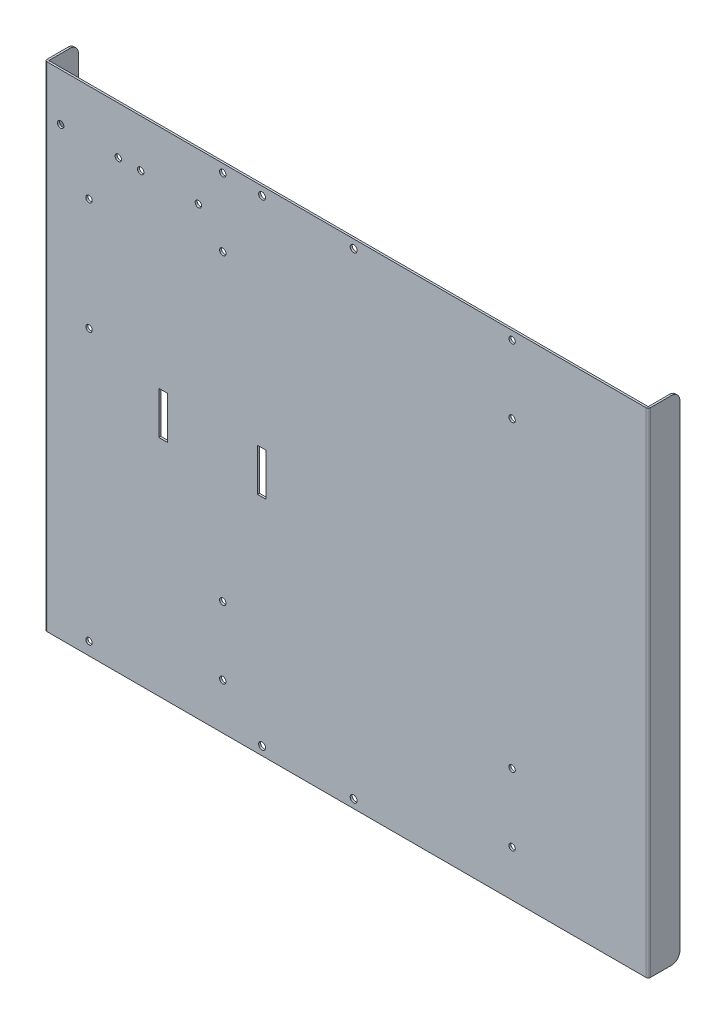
ISO-10303-21;
HEADER;
FILE_DESCRIPTION(('STEP AP214'),'2;1');
FILE_NAME('part.step','',(''),(''),'','','');
FILE_SCHEMA(('AUTOMOTIVE_DESIGN { 1 0 10303 214 1 1 1 1 }'));
ENDSEC;
DATA;
#1=APPLICATION_CONTEXT('core data for automotive mechanical design processes');
#2=APPLICATION_PROTOCOL_DEFINITION('international standard','automotive_design',2000,#1);
#3=PRODUCT_CONTEXT('',#1,'mechanical');
#4=PRODUCT('Part','Part','',(#3));
#5=PRODUCT_RELATED_PRODUCT_CATEGORY('part','',(#4));
#6=PRODUCT_DEFINITION_FORMATION('','',#4);
#7=PRODUCT_DEFINITION_CONTEXT('part definition',#1,'design');
#8=PRODUCT_DEFINITION('design','',#6,#7);
#9=PRODUCT_DEFINITION_SHAPE('','',#8);
#10=(LENGTH_UNIT() NAMED_UNIT(*) SI_UNIT(.MILLI.,.METRE.));
#11=(NAMED_UNIT(*) PLANE_ANGLE_UNIT() SI_UNIT($,.RADIAN.));
#12=(NAMED_UNIT(*) SI_UNIT($,.STERADIAN.) SOLID_ANGLE_UNIT());
#13=UNCERTAINTY_MEASURE_WITH_UNIT(LENGTH_MEASURE(1.E-05),#10,'distance_accuracy_value','');
#14=(GEOMETRIC_REPRESENTATION_CONTEXT(3) GLOBAL_UNCERTAINTY_ASSIGNED_CONTEXT((#13)) GLOBAL_UNIT_ASSIGNED_CONTEXT((#10,
#11,#12)) REPRESENTATION_CONTEXT('',''));
#15=CARTESIAN_POINT('',(0.,0.,0.));
#16=DIRECTION('',(0.,0.,1.));
#17=DIRECTION('',(1.,0.,0.));
#18=AXIS2_PLACEMENT_3D('',#15,#16,#17);
#19=CARTESIAN_POINT('',(0.,0.,-1.5));
#20=DIRECTION('',(0.,0.,1.));
#21=DIRECTION('',(1.,0.,0.));
#22=AXIS2_PLACEMENT_3D('',#19,#20,#21);
#23=PLANE('',#22);
#24=DIRECTION('',(0.,1.,0.));
#25=VECTOR('',#24,1.);
#26=CARTESIAN_POINT('',(-60.07208357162,-16.90051996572,-1.5));
#27=LINE('',#26,#25);
#28=CARTESIAN_POINT('',(-60.07208357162,-16.90051996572,-1.5));
#29=VERTEX_POINT('',#28);
#30=CARTESIAN_POINT('',(-60.07208357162,14.84948003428,-1.5));
#31=VERTEX_POINT('',#30);
#32=EDGE_CURVE('E273',#29,#31,#27,.T.);
#33=ORIENTED_EDGE('',*,*,#32,.T.);
#34=DIRECTION('',(-1.,0.,0.));
#35=VECTOR('',#34,1.);
#36=CARTESIAN_POINT('',(-60.07208357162,14.84948003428,-1.5));
#37=LINE('',#36,#35);
#38=CARTESIAN_POINT('',(-66.42208357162,14.84948003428,-1.5));
#39=VERTEX_POINT('',#38);
#40=EDGE_CURVE('E245',#31,#39,#37,.T.);
#41=ORIENTED_EDGE('',*,*,#40,.T.);
#42=DIRECTION('',(0.,-1.,0.));
#43=VECTOR('',#42,1.);
#44=CARTESIAN_POINT('',(-66.42208357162,14.84948003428,-1.5));
#45=LINE('',#44,#43);
#46=CARTESIAN_POINT('',(-66.42208357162,-16.90051996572,-1.5));
#47=VERTEX_POINT('',#46);
#48=EDGE_CURVE('E279',#39,#47,#45,.T.);
#49=ORIENTED_EDGE('',*,*,#48,.T.);
#50=DIRECTION('',(1.,0.,0.));
#51=VECTOR('',#50,1.);
#52=CARTESIAN_POINT('',(-66.42208357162,-16.90051996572,-1.5));
#53=LINE('',#52,#51);
#54=EDGE_CURVE('E275',#47,#29,#53,.T.);
#55=ORIENTED_EDGE('',*,*,#54,.T.);
#56=EDGE_LOOP('',(#33,#41,#49,#55));
#57=FACE_BOUND('',#56,.T.);
#58=DIRECTION('',(0.,1.,0.));
#59=VECTOR('',#58,1.);
#60=CARTESIAN_POINT('',(-133.73208357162,-16.90051996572,-1.5));
#61=LINE('',#60,#59);
#62=CARTESIAN_POINT('',(-133.73208357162,-16.90051996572,-1.5));
#63=VERTEX_POINT('',#62);
#64=CARTESIAN_POINT('',(-133.73208357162,14.84948003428,-1.5));
#65=VERTEX_POINT('',#64);
#66=EDGE_CURVE('E286',#63,#65,#61,.T.);
#67=ORIENTED_EDGE('',*,*,#66,.T.);
#68=DIRECTION('',(-1.,0.,0.));
#69=VECTOR('',#68,1.);
#70=CARTESIAN_POINT('',(-133.73208357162,14.84948003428,-1.5));
#71=LINE('',#70,#69);
#72=CARTESIAN_POINT('',(-140.08208357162,14.84948003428,-1.5));
#73=VERTEX_POINT('',#72);
#74=EDGE_CURVE('E298',#65,#73,#71,.T.);
#75=ORIENTED_EDGE('',*,*,#74,.T.);
#76=DIRECTION('',(0.,-1.,0.));
#77=VECTOR('',#76,1.);
#78=CARTESIAN_POINT('',(-140.08208357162,14.84948003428,-1.5));
#79=LINE('',#78,#77);
#80=CARTESIAN_POINT('',(-140.08208357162,-16.90051996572,-1.5));
#81=VERTEX_POINT('',#80);
#82=EDGE_CURVE('E310',#73,#81,#79,.T.);
#83=ORIENTED_EDGE('',*,*,#82,.T.);
#84=DIRECTION('',(1.,0.,0.));
#85=VECTOR('',#84,1.);
#86=CARTESIAN_POINT('',(-140.08208357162,-16.90051996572,-1.5));
#87=LINE('',#86,#85);
#88=EDGE_CURVE('E307',#81,#63,#87,.T.);
#89=ORIENTED_EDGE('',*,*,#88,.T.);
#90=EDGE_LOOP('',(#67,#75,#83,#89));
#91=FACE_BOUND('',#90,.T.);
#92=CARTESIAN_POINT('',(-110.56852029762,148.71327104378,-1.5));
#93=DIRECTION('',(0.,0.,1.));
#94=DIRECTION('',(1.,0.,0.));
#95=AXIS2_PLACEMENT_3D('',#92,#93,#94);
#96=CIRCLE('',#95,2.38759999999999);
#97=CARTESIAN_POINT('',(-108.18092029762,148.71327104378,-1.5));
#98=VERTEX_POINT('',#97);
#99=EDGE_CURVE('E317',#98,#98,#96,.T.);
#100=ORIENTED_EDGE('',*,*,#99,.T.);
#101=EDGE_LOOP('',(#100));
#102=FACE_BOUND('',#101,.T.);
#103=CARTESIAN_POINT('',(-153.62152029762,148.71327104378,-1.5));
#104=DIRECTION('',(0.,0.,1.));
#105=DIRECTION('',(1.,0.,0.));
#106=AXIS2_PLACEMENT_3D('',#103,#104,#105);
#107=CIRCLE('',#106,2.38759999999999);
#108=CARTESIAN_POINT('',(-151.23392029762,148.71327104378,-1.5));
#109=VERTEX_POINT('',#108);
#110=EDGE_CURVE('E323',#109,#109,#107,.T.);
#111=ORIENTED_EDGE('',*,*,#110,.T.);
#112=EDGE_LOOP('',(#111));
#113=FACE_BOUND('',#112,.T.);
#114=CARTESIAN_POINT('',(-192.151,27.559,-1.5));
#115=DIRECTION('',(0.,0.,1.));
#116=DIRECTION('',(1.,0.,0.));
#117=AXIS2_PLACEMENT_3D('',#114,#115,#116);
#118=CIRCLE('',#117,2.38760000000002);
#119=CARTESIAN_POINT('',(-189.7634,27.559,-1.5));
#120=VERTEX_POINT('',#119);
#121=EDGE_CURVE('E1210',#120,#120,#118,.T.);
#122=ORIENTED_EDGE('',*,*,#121,.T.);
#123=EDGE_LOOP('',(#122));
#124=FACE_BOUND('',#123,.T.);
#125=CARTESIAN_POINT('',(123.571,-99.06,-1.5));
#126=DIRECTION('',(0.,0.,1.));
#127=DIRECTION('',(1.,0.,0.));
#128=AXIS2_PLACEMENT_3D('',#125,#126,#127);
#129=CIRCLE('',#128,2.38760000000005);
#130=CARTESIAN_POINT('',(125.9586,-99.06,-1.5));
#131=VERTEX_POINT('',#130);
#132=EDGE_CURVE('E1216',#131,#131,#129,.T.);
#133=ORIENTED_EDGE('',*,*,#132,.T.);
#134=EDGE_LOOP('',(#133));
#135=FACE_BOUND('',#134,.T.);
#136=CARTESIAN_POINT('',(123.571,-149.86,-1.5));
#137=DIRECTION('',(0.,0.,1.));
#138=DIRECTION('',(1.,0.,0.));
#139=AXIS2_PLACEMENT_3D('',#136,#137,#138);
#140=CIRCLE('',#139,2.38760000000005);
#141=CARTESIAN_POINT('',(125.9586,-149.86,-1.5));
#142=VERTEX_POINT('',#141);
#143=EDGE_CURVE('E1222',#142,#142,#140,.T.);
#144=ORIENTED_EDGE('',*,*,#143,.T.);
#145=EDGE_LOOP('',(#144));
#146=FACE_BOUND('',#145,.T.);
#147=CARTESIAN_POINT('',(5.334,-177.8,-1.5));
#148=DIRECTION('',(0.,0.,1.));
#149=DIRECTION('',(1.,0.,0.));
#150=AXIS2_PLACEMENT_3D('',#147,#148,#149);
#151=CIRCLE('',#150,2.57810000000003);
#152=CARTESIAN_POINT('',(7.91210000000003,-177.8,-1.5));
#153=VERTEX_POINT('',#152);
#154=EDGE_CURVE('E1191',#153,#153,#151,.T.);
#155=ORIENTED_EDGE('',*,*,#154,.T.);
#156=EDGE_LOOP('',(#155));
#157=FACE_BOUND('',#156,.T.);
#158=CARTESIAN_POINT('',(123.571,127.,-1.5));
#159=DIRECTION('',(0.,0.,1.));
#160=DIRECTION('',(1.,0.,0.));
#161=AXIS2_PLACEMENT_3D('',#158,#159,#160);
#162=CIRCLE('',#161,2.38760000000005);
#163=CARTESIAN_POINT('',(125.9586,127.,-1.5));
#164=VERTEX_POINT('',#163);
#165=EDGE_CURVE('E352',#164,#164,#162,.T.);
#166=ORIENTED_EDGE('',*,*,#165,.T.);
#167=EDGE_LOOP('',(#166));
#168=FACE_BOUND('',#167,.T.);
#169=CARTESIAN_POINT('',(5.334,177.8,-1.5));
#170=DIRECTION('',(0.,0.,1.));
#171=DIRECTION('',(1.,0.,0.));
#172=AXIS2_PLACEMENT_3D('',#169,#170,#171);
#173=CIRCLE('',#172,2.57810000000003);
#174=CARTESIAN_POINT('',(7.91210000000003,177.8,-1.5));
#175=VERTEX_POINT('',#174);
#176=EDGE_CURVE('E358',#175,#175,#173,.T.);
#177=ORIENTED_EDGE('',*,*,#176,.T.);
#178=EDGE_LOOP('',(#177));
#179=FACE_BOUND('',#178,.T.);
#180=CARTESIAN_POINT('',(-62.992,177.8,-1.5));
#181=DIRECTION('',(0.,0.,1.));
#182=DIRECTION('',(1.,0.,0.));
#183=AXIS2_PLACEMENT_3D('',#180,#181,#182);
#184=CIRCLE('',#183,2.57810000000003);
#185=CARTESIAN_POINT('',(-60.4139,177.8,-1.5));
#186=VERTEX_POINT('',#185);
#187=EDGE_CURVE('E364',#186,#186,#184,.T.);
#188=ORIENTED_EDGE('',*,*,#187,.T.);
#189=EDGE_LOOP('',(#188));
#190=FACE_BOUND('',#189,.T.);
#191=CARTESIAN_POINT('',(-92.3289999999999,177.8,-1.5));
#192=DIRECTION('',(0.,0.,1.));
#193=DIRECTION('',(1.,0.,0.));
#194=AXIS2_PLACEMENT_3D('',#191,#192,#193);
#195=CIRCLE('',#194,2.38759999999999);
#196=CARTESIAN_POINT('',(-89.9413999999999,177.8,-1.5));
#197=VERTEX_POINT('',#196);
#198=EDGE_CURVE('E330',#197,#197,#195,.T.);
#199=ORIENTED_EDGE('',*,*,#198,.T.);
#200=EDGE_LOOP('',(#199));
#201=FACE_BOUND('',#200,.T.);
#202=CARTESIAN_POINT('',(-170.25764060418,148.71327104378,-1.5));
#203=DIRECTION('',(0.,0.,1.));
#204=DIRECTION('',(1.,0.,0.));
#205=AXIS2_PLACEMENT_3D('',#202,#203,#204);
#206=CIRCLE('',#205,2.38759999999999);
#207=CARTESIAN_POINT('',(-167.87004060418,148.71327104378,-1.5));
#208=VERTEX_POINT('',#207);
#209=EDGE_CURVE('E331',#208,#208,#206,.T.);
#210=ORIENTED_EDGE('',*,*,#209,.T.);
#211=EDGE_LOOP('',(#210));
#212=FACE_BOUND('',#211,.T.);
#213=CARTESIAN_POINT('',(-213.31064060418,148.71327104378,-1.5));
#214=DIRECTION('',(0.,0.,1.));
#215=DIRECTION('',(1.,0.,0.));
#216=AXIS2_PLACEMENT_3D('',#213,#214,#215);
#217=CIRCLE('',#216,2.38759999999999);
#218=CARTESIAN_POINT('',(-210.92304060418,148.71327104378,-1.5));
#219=VERTEX_POINT('',#218);
#220=EDGE_CURVE('E337',#219,#219,#217,.T.);
#221=ORIENTED_EDGE('',*,*,#220,.T.);
#222=EDGE_LOOP('',(#221));
#223=FACE_BOUND('',#222,.T.);
#224=CARTESIAN_POINT('',(-192.151,111.125,-1.5));
#225=DIRECTION('',(0.,0.,1.));
#226=DIRECTION('',(1.,0.,0.));
#227=AXIS2_PLACEMENT_3D('',#224,#225,#226);
#228=CIRCLE('',#227,2.38760000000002);
#229=CARTESIAN_POINT('',(-189.7634,111.125,-1.5));
#230=VERTEX_POINT('',#229);
#231=EDGE_CURVE('E343',#230,#230,#228,.T.);
#232=ORIENTED_EDGE('',*,*,#231,.T.);
#233=EDGE_LOOP('',(#232));
#234=FACE_BOUND('',#233,.T.);
#235=CARTESIAN_POINT('',(-92.3289999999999,127.,-1.5));
#236=DIRECTION('',(0.,0.,1.));
#237=DIRECTION('',(1.,0.,0.));
#238=AXIS2_PLACEMENT_3D('',#235,#236,#237);
#239=CIRCLE('',#238,2.38759999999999);
#240=CARTESIAN_POINT('',(-89.9413999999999,127.,-1.5));
#241=VERTEX_POINT('',#240);
#242=EDGE_CURVE('E265',#241,#241,#239,.T.);
#243=ORIENTED_EDGE('',*,*,#242,.T.);
#244=EDGE_LOOP('',(#243));
#245=FACE_BOUND('',#244,.T.);
#246=CARTESIAN_POINT('',(-192.151,-174.625,-1.5));
#247=DIRECTION('',(0.,0.,1.));
#248=DIRECTION('',(1.,0.,0.));
#249=AXIS2_PLACEMENT_3D('',#246,#247,#248);
#250=CIRCLE('',#249,2.38760000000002);
#251=CARTESIAN_POINT('',(-189.7634,-174.625,-1.5));
#252=VERTEX_POINT('',#251);
#253=EDGE_CURVE('E1199',#252,#252,#250,.T.);
#254=ORIENTED_EDGE('',*,*,#253,.T.);
#255=EDGE_LOOP('',(#254));
#256=FACE_BOUND('',#255,.T.);
#257=CARTESIAN_POINT('',(-92.3289999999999,-99.06,-1.5));
#258=DIRECTION('',(0.,0.,1.));
#259=DIRECTION('',(1.,0.,0.));
#260=AXIS2_PLACEMENT_3D('',#257,#258,#259);
#261=CIRCLE('',#260,2.38759999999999);
#262=CARTESIAN_POINT('',(-89.9413999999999,-99.06,-1.5));
#263=VERTEX_POINT('',#262);
#264=EDGE_CURVE('E1262',#263,#263,#261,.T.);
#265=ORIENTED_EDGE('',*,*,#264,.T.);
#266=EDGE_LOOP('',(#265));
#267=FACE_BOUND('',#266,.T.);
#268=CARTESIAN_POINT('',(-92.3289999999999,-149.86,-1.5));
#269=DIRECTION('',(0.,0.,1.));
#270=DIRECTION('',(1.,0.,0.));
#271=AXIS2_PLACEMENT_3D('',#268,#269,#270);
#272=CIRCLE('',#271,2.38759999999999);
#273=CARTESIAN_POINT('',(-89.9413999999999,-149.86,-1.5));
#274=VERTEX_POINT('',#273);
#275=EDGE_CURVE('E1204',#274,#274,#272,.T.);
#276=ORIENTED_EDGE('',*,*,#275,.T.);
#277=EDGE_LOOP('',(#276));
#278=FACE_BOUND('',#277,.T.);
#279=CARTESIAN_POINT('',(-62.992,-177.8,-1.5));
#280=DIRECTION('',(0.,0.,1.));
#281=DIRECTION('',(1.,0.,0.));
#282=AXIS2_PLACEMENT_3D('',#279,#280,#281);
#283=CIRCLE('',#282,2.57810000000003);
#284=CARTESIAN_POINT('',(-60.4139,-177.8,-1.5));
#285=VERTEX_POINT('',#284);
#286=EDGE_CURVE('E1186',#285,#285,#283,.T.);
#287=ORIENTED_EDGE('',*,*,#286,.T.);
#288=EDGE_LOOP('',(#287));
#289=FACE_BOUND('',#288,.T.);
#290=CARTESIAN_POINT('',(123.571,177.8,-1.5));
#291=DIRECTION('',(0.,0.,1.));
#292=DIRECTION('',(1.,0.,0.));
#293=AXIS2_PLACEMENT_3D('',#290,#291,#292);
#294=CIRCLE('',#293,2.38760000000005);
#295=CARTESIAN_POINT('',(125.9586,177.8,-1.5));
#296=VERTEX_POINT('',#295);
#297=EDGE_CURVE('E372',#296,#296,#294,.T.);
#298=ORIENTED_EDGE('',*,*,#297,.T.);
#299=EDGE_LOOP('',(#298));
#300=FACE_BOUND('',#299,.T.);
#301=DIRECTION('',(0.,1.,0.));
#302=VECTOR('',#301,1.);
#303=CARTESIAN_POINT('',(-223.4678,184.15,-1.5));
#304=LINE('',#303,#302);
#305=CARTESIAN_POINT('',(-223.4678,184.15,-1.5));
#306=VERTEX_POINT('',#305);
#307=CARTESIAN_POINT('',(-223.4678,-184.15,-1.5));
#308=VERTEX_POINT('',#307);
#309=EDGE_CURVE('E417',#306,#308,#304,.F.);
#310=ORIENTED_EDGE('',*,*,#309,.F.);
#311=DIRECTION('',(-1.,0.,0.));
#312=VECTOR('',#311,1.);
#313=CARTESIAN_POINT('',(-225.171,184.15,-1.5));
#314=LINE('',#313,#312);
#315=CARTESIAN_POINT('',(223.4678,184.15,-1.5));
#316=VERTEX_POINT('',#315);
#317=EDGE_CURVE('E481',#316,#306,#314,.T.);
#318=ORIENTED_EDGE('',*,*,#317,.F.);
#319=DIRECTION('',(0.,-1.,0.));
#320=VECTOR('',#319,1.);
#321=CARTESIAN_POINT('',(223.4678,-184.15,-1.5));
#322=LINE('',#321,#320);
#323=CARTESIAN_POINT('',(223.4678,-184.15,-1.5));
#324=VERTEX_POINT('',#323);
#325=EDGE_CURVE('E468',#324,#316,#322,.F.);
#326=ORIENTED_EDGE('',*,*,#325,.F.);
#327=DIRECTION('',(1.,0.,0.));
#328=VECTOR('',#327,1.);
#329=CARTESIAN_POINT('',(-225.171,-184.15,-1.5));
#330=LINE('',#329,#328);
#331=EDGE_CURVE('E478',#308,#324,#330,.T.);
#332=ORIENTED_EDGE('',*,*,#331,.F.);
#333=EDGE_LOOP('',(#310,#318,#326,#332));
#334=FACE_BOUND('',#333,.T.);
#335=ADVANCED_FACE('F77',(#57,#91,#102,#113,#124,#135,#146,#157,#168,#179,#190,#201,#212,#223,
#234,#245,#256,#267,#278,#289,#300,#334),#23,.F.);
#336=CARTESIAN_POINT('',(0.,0.,0.));
#337=DIRECTION('',(0.,0.,1.));
#338=DIRECTION('',(1.,0.,0.));
#339=AXIS2_PLACEMENT_3D('',#336,#337,#338);
#340=PLANE('',#339);
#341=DIRECTION('',(-1.,0.,0.));
#342=VECTOR('',#341,1.);
#343=CARTESIAN_POINT('',(-60.07208357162,14.84948003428,0.));
#344=LINE('',#343,#342);
#345=CARTESIAN_POINT('',(-60.07208357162,14.84948003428,0.));
#346=VERTEX_POINT('',#345);
#347=CARTESIAN_POINT('',(-66.42208357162,14.84948003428,0.));
#348=VERTEX_POINT('',#347);
#349=EDGE_CURVE('E242',#346,#348,#344,.T.);
#350=ORIENTED_EDGE('',*,*,#349,.F.);
#351=DIRECTION('',(0.,1.,0.));
#352=VECTOR('',#351,1.);
#353=CARTESIAN_POINT('',(-60.07208357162,-16.90051996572,0.));
#354=LINE('',#353,#352);
#355=CARTESIAN_POINT('',(-60.07208357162,-16.90051996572,0.));
#356=VERTEX_POINT('',#355);
#357=EDGE_CURVE('E253',#356,#346,#354,.T.);
#358=ORIENTED_EDGE('',*,*,#357,.F.);
#359=DIRECTION('',(1.,0.,0.));
#360=VECTOR('',#359,1.);
#361=CARTESIAN_POINT('',(-66.42208357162,-16.90051996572,0.));
#362=LINE('',#361,#360);
#363=CARTESIAN_POINT('',(-66.42208357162,-16.90051996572,0.));
#364=VERTEX_POINT('',#363);
#365=EDGE_CURVE('E258',#364,#356,#362,.T.);
#366=ORIENTED_EDGE('',*,*,#365,.F.);
#367=DIRECTION('',(0.,-1.,0.));
#368=VECTOR('',#367,1.);
#369=CARTESIAN_POINT('',(-66.42208357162,14.84948003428,0.));
#370=LINE('',#369,#368);
#371=EDGE_CURVE('E264',#348,#364,#370,.T.);
#372=ORIENTED_EDGE('',*,*,#371,.F.);
#373=EDGE_LOOP('',(#350,#358,#366,#372));
#374=FACE_BOUND('',#373,.T.);
#375=DIRECTION('',(-1.,0.,0.));
#376=VECTOR('',#375,1.);
#377=CARTESIAN_POINT('',(-133.73208357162,14.84948003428,0.));
#378=LINE('',#377,#376);
#379=CARTESIAN_POINT('',(-133.73208357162,14.84948003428,0.));
#380=VERTEX_POINT('',#379);
#381=CARTESIAN_POINT('',(-140.08208357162,14.84948003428,0.));
#382=VERTEX_POINT('',#381);
#383=EDGE_CURVE('E250',#380,#382,#378,.T.);
#384=ORIENTED_EDGE('',*,*,#383,.F.);
#385=DIRECTION('',(0.,1.,0.));
#386=VECTOR('',#385,1.);
#387=CARTESIAN_POINT('',(-133.73208357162,-16.90051996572,0.));
#388=LINE('',#387,#386);
#389=CARTESIAN_POINT('',(-133.73208357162,-16.90051996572,0.));
#390=VERTEX_POINT('',#389);
#391=EDGE_CURVE('E294',#390,#380,#388,.T.);
#392=ORIENTED_EDGE('',*,*,#391,.F.);
#393=DIRECTION('',(1.,0.,0.));
#394=VECTOR('',#393,1.);
#395=CARTESIAN_POINT('',(-140.08208357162,-16.90051996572,0.));
#396=LINE('',#395,#394);
#397=CARTESIAN_POINT('',(-140.08208357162,-16.90051996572,0.));
#398=VERTEX_POINT('',#397);
#399=EDGE_CURVE('E297',#398,#390,#396,.T.);
#400=ORIENTED_EDGE('',*,*,#399,.F.);
#401=DIRECTION('',(0.,-1.,0.));
#402=VECTOR('',#401,1.);
#403=CARTESIAN_POINT('',(-140.08208357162,14.84948003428,0.));
#404=LINE('',#403,#402);
#405=EDGE_CURVE('E301',#382,#398,#404,.T.);
#406=ORIENTED_EDGE('',*,*,#405,.F.);
#407=EDGE_LOOP('',(#384,#392,#400,#406));
#408=FACE_BOUND('',#407,.T.);
#409=CARTESIAN_POINT('',(-110.56852029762,148.71327104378,0.));
#410=DIRECTION('',(0.,0.,1.));
#411=DIRECTION('',(1.,0.,0.));
#412=AXIS2_PLACEMENT_3D('',#409,#410,#411);
#413=CIRCLE('',#412,2.38759999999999);
#414=CARTESIAN_POINT('',(-108.18092029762,148.71327104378,0.));
#415=VERTEX_POINT('',#414);
#416=EDGE_CURVE('E293',#415,#415,#413,.T.);
#417=ORIENTED_EDGE('',*,*,#416,.F.);
#418=EDGE_LOOP('',(#417));
#419=FACE_BOUND('',#418,.T.);
#420=CARTESIAN_POINT('',(-153.62152029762,148.71327104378,0.));
#421=DIRECTION('',(0.,0.,1.));
#422=DIRECTION('',(1.,0.,0.));
#423=AXIS2_PLACEMENT_3D('',#420,#421,#422);
#424=CIRCLE('',#423,2.38759999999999);
#425=CARTESIAN_POINT('',(-151.23392029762,148.71327104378,0.));
#426=VERTEX_POINT('',#425);
#427=EDGE_CURVE('E320',#426,#426,#424,.T.);
#428=ORIENTED_EDGE('',*,*,#427,.F.);
#429=EDGE_LOOP('',(#428));
#430=FACE_BOUND('',#429,.T.);
#431=CARTESIAN_POINT('',(-192.151,27.559,0.));
#432=DIRECTION('',(0.,0.,1.));
#433=DIRECTION('',(1.,0.,0.));
#434=AXIS2_PLACEMENT_3D('',#431,#432,#433);
#435=CIRCLE('',#434,2.38760000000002);
#436=CARTESIAN_POINT('',(-189.7634,27.559,0.));
#437=VERTEX_POINT('',#436);
#438=EDGE_CURVE('E326',#437,#437,#435,.T.);
#439=ORIENTED_EDGE('',*,*,#438,.F.);
#440=EDGE_LOOP('',(#439));
#441=FACE_BOUND('',#440,.T.);
#442=CARTESIAN_POINT('',(123.571,-99.06,0.));
#443=DIRECTION('',(0.,0.,1.));
#444=DIRECTION('',(1.,0.,0.));
#445=AXIS2_PLACEMENT_3D('',#442,#443,#444);
#446=CIRCLE('',#445,2.38760000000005);
#447=CARTESIAN_POINT('',(125.9586,-99.06,0.));
#448=VERTEX_POINT('',#447);
#449=EDGE_CURVE('E1213',#448,#448,#446,.T.);
#450=ORIENTED_EDGE('',*,*,#449,.F.);
#451=EDGE_LOOP('',(#450));
#452=FACE_BOUND('',#451,.T.);
#453=CARTESIAN_POINT('',(123.571,-149.86,0.));
#454=DIRECTION('',(0.,0.,1.));
#455=DIRECTION('',(1.,0.,0.));
#456=AXIS2_PLACEMENT_3D('',#453,#454,#455);
#457=CIRCLE('',#456,2.38760000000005);
#458=CARTESIAN_POINT('',(125.9586,-149.86,0.));
#459=VERTEX_POINT('',#458);
#460=EDGE_CURVE('E1219',#459,#459,#457,.T.);
#461=ORIENTED_EDGE('',*,*,#460,.F.);
#462=EDGE_LOOP('',(#461));
#463=FACE_BOUND('',#462,.T.);
#464=CARTESIAN_POINT('',(5.334,-177.8,0.));
#465=DIRECTION('',(0.,0.,1.));
#466=DIRECTION('',(1.,0.,0.));
#467=AXIS2_PLACEMENT_3D('',#464,#465,#466);
#468=CIRCLE('',#467,2.57810000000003);
#469=CARTESIAN_POINT('',(7.91210000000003,-177.8,0.));
#470=VERTEX_POINT('',#469);
#471=EDGE_CURVE('E1194',#470,#470,#468,.T.);
#472=ORIENTED_EDGE('',*,*,#471,.F.);
#473=EDGE_LOOP('',(#472));
#474=FACE_BOUND('',#473,.T.);
#475=CARTESIAN_POINT('',(123.571,127.,0.));
#476=DIRECTION('',(0.,0.,1.));
#477=DIRECTION('',(1.,0.,0.));
#478=AXIS2_PLACEMENT_3D('',#475,#476,#477);
#479=CIRCLE('',#478,2.38760000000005);
#480=CARTESIAN_POINT('',(125.9586,127.,0.));
#481=VERTEX_POINT('',#480);
#482=EDGE_CURVE('E348',#481,#481,#479,.T.);
#483=ORIENTED_EDGE('',*,*,#482,.F.);
#484=EDGE_LOOP('',(#483));
#485=FACE_BOUND('',#484,.T.);
#486=CARTESIAN_POINT('',(5.334,177.8,0.));
#487=DIRECTION('',(0.,0.,1.));
#488=DIRECTION('',(1.,0.,0.));
#489=AXIS2_PLACEMENT_3D('',#486,#487,#488);
#490=CIRCLE('',#489,2.57810000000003);
#491=CARTESIAN_POINT('',(7.91210000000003,177.8,0.));
#492=VERTEX_POINT('',#491);
#493=EDGE_CURVE('E355',#492,#492,#490,.T.);
#494=ORIENTED_EDGE('',*,*,#493,.F.);
#495=EDGE_LOOP('',(#494));
#496=FACE_BOUND('',#495,.T.);
#497=CARTESIAN_POINT('',(-62.992,177.8,0.));
#498=DIRECTION('',(0.,0.,1.));
#499=DIRECTION('',(1.,0.,0.));
#500=AXIS2_PLACEMENT_3D('',#497,#498,#499);
#501=CIRCLE('',#500,2.57810000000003);
#502=CARTESIAN_POINT('',(-60.4139,177.8,0.));
#503=VERTEX_POINT('',#502);
#504=EDGE_CURVE('E361',#503,#503,#501,.T.);
#505=ORIENTED_EDGE('',*,*,#504,.F.);
#506=EDGE_LOOP('',(#505));
#507=FACE_BOUND('',#506,.T.);
#508=CARTESIAN_POINT('',(-92.3289999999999,177.8,0.));
#509=DIRECTION('',(0.,0.,1.));
#510=DIRECTION('',(1.,0.,0.));
#511=AXIS2_PLACEMENT_3D('',#508,#509,#510);
#512=CIRCLE('',#511,2.38759999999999);
#513=CARTESIAN_POINT('',(-89.9413999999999,177.8,0.));
#514=VERTEX_POINT('',#513);
#515=EDGE_CURVE('E367',#514,#514,#512,.T.);
#516=ORIENTED_EDGE('',*,*,#515,.F.);
#517=EDGE_LOOP('',(#516));
#518=FACE_BOUND('',#517,.T.);
#519=CARTESIAN_POINT('',(-170.25764060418,148.71327104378,0.));
#520=DIRECTION('',(0.,0.,1.));
#521=DIRECTION('',(1.,0.,0.));
#522=AXIS2_PLACEMENT_3D('',#519,#520,#521);
#523=CIRCLE('',#522,2.38759999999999);
#524=CARTESIAN_POINT('',(-167.87004060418,148.71327104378,0.));
#525=VERTEX_POINT('',#524);
#526=EDGE_CURVE('E327',#525,#525,#523,.T.);
#527=ORIENTED_EDGE('',*,*,#526,.F.);
#528=EDGE_LOOP('',(#527));
#529=FACE_BOUND('',#528,.T.);
#530=CARTESIAN_POINT('',(-213.31064060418,148.71327104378,0.));
#531=DIRECTION('',(0.,0.,1.));
#532=DIRECTION('',(1.,0.,0.));
#533=AXIS2_PLACEMENT_3D('',#530,#531,#532);
#534=CIRCLE('',#533,2.38759999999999);
#535=CARTESIAN_POINT('',(-210.92304060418,148.71327104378,0.));
#536=VERTEX_POINT('',#535);
#537=EDGE_CURVE('E334',#536,#536,#534,.T.);
#538=ORIENTED_EDGE('',*,*,#537,.F.);
#539=EDGE_LOOP('',(#538));
#540=FACE_BOUND('',#539,.T.);
#541=CARTESIAN_POINT('',(-192.151,111.125,0.));
#542=DIRECTION('',(0.,0.,1.));
#543=DIRECTION('',(1.,0.,0.));
#544=AXIS2_PLACEMENT_3D('',#541,#542,#543);
#545=CIRCLE('',#544,2.38760000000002);
#546=CARTESIAN_POINT('',(-189.7634,111.125,0.));
#547=VERTEX_POINT('',#546);
#548=EDGE_CURVE('E340',#547,#547,#545,.T.);
#549=ORIENTED_EDGE('',*,*,#548,.F.);
#550=EDGE_LOOP('',(#549));
#551=FACE_BOUND('',#550,.T.);
#552=CARTESIAN_POINT('',(-92.3289999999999,127.,0.));
#553=DIRECTION('',(0.,0.,1.));
#554=DIRECTION('',(1.,0.,0.));
#555=AXIS2_PLACEMENT_3D('',#552,#553,#554);
#556=CIRCLE('',#555,2.38759999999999);
#557=CARTESIAN_POINT('',(-89.9413999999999,127.,0.));
#558=VERTEX_POINT('',#557);
#559=EDGE_CURVE('E268',#558,#558,#556,.T.);
#560=ORIENTED_EDGE('',*,*,#559,.F.);
#561=EDGE_LOOP('',(#560));
#562=FACE_BOUND('',#561,.T.);
#563=CARTESIAN_POINT('',(-192.151,-174.625,0.));
#564=DIRECTION('',(0.,0.,1.));
#565=DIRECTION('',(1.,0.,0.));
#566=AXIS2_PLACEMENT_3D('',#563,#564,#565);
#567=CIRCLE('',#566,2.38760000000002);
#568=CARTESIAN_POINT('',(-189.7634,-174.625,0.));
#569=VERTEX_POINT('',#568);
#570=EDGE_CURVE('E1255',#569,#569,#567,.T.);
#571=ORIENTED_EDGE('',*,*,#570,.F.);
#572=EDGE_LOOP('',(#571));
#573=FACE_BOUND('',#572,.T.);
#574=CARTESIAN_POINT('',(-92.3289999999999,-99.06,0.));
#575=DIRECTION('',(0.,0.,1.));
#576=DIRECTION('',(1.,0.,0.));
#577=AXIS2_PLACEMENT_3D('',#574,#575,#576);
#578=CIRCLE('',#577,2.38759999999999);
#579=CARTESIAN_POINT('',(-89.9413999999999,-99.06,0.));
#580=VERTEX_POINT('',#579);
#581=EDGE_CURVE('E1207',#580,#580,#578,.T.);
#582=ORIENTED_EDGE('',*,*,#581,.F.);
#583=EDGE_LOOP('',(#582));
#584=FACE_BOUND('',#583,.T.);
#585=CARTESIAN_POINT('',(-92.3289999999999,-149.86,0.));
#586=DIRECTION('',(0.,0.,1.));
#587=DIRECTION('',(1.,0.,0.));
#588=AXIS2_PLACEMENT_3D('',#585,#586,#587);
#589=CIRCLE('',#588,2.38759999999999);
#590=CARTESIAN_POINT('',(-89.9413999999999,-149.86,0.));
#591=VERTEX_POINT('',#590);
#592=EDGE_CURVE('E1196',#591,#591,#589,.T.);
#593=ORIENTED_EDGE('',*,*,#592,.F.);
#594=EDGE_LOOP('',(#593));
#595=FACE_BOUND('',#594,.T.);
#596=CARTESIAN_POINT('',(-62.992,-177.8,0.));
#597=DIRECTION('',(0.,0.,1.));
#598=DIRECTION('',(1.,0.,0.));
#599=AXIS2_PLACEMENT_3D('',#596,#597,#598);
#600=CIRCLE('',#599,2.57810000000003);
#601=CARTESIAN_POINT('',(-60.4139,-177.8,0.));
#602=VERTEX_POINT('',#601);
#603=EDGE_CURVE('E1189',#602,#602,#600,.T.);
#604=ORIENTED_EDGE('',*,*,#603,.F.);
#605=EDGE_LOOP('',(#604));
#606=FACE_BOUND('',#605,.T.);
#607=CARTESIAN_POINT('',(123.571,177.8,0.));
#608=DIRECTION('',(0.,0.,1.));
#609=DIRECTION('',(1.,0.,0.));
#610=AXIS2_PLACEMENT_3D('',#607,#608,#609);
#611=CIRCLE('',#610,2.38760000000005);
#612=CARTESIAN_POINT('',(125.9586,177.8,0.));
#613=VERTEX_POINT('',#612);
#614=EDGE_CURVE('E351',#613,#613,#611,.T.);
#615=ORIENTED_EDGE('',*,*,#614,.F.);
#616=EDGE_LOOP('',(#615));
#617=FACE_BOUND('',#616,.T.);
#618=DIRECTION('',(-1.,0.,0.));
#619=VECTOR('',#618,1.);
#620=CARTESIAN_POINT('',(-225.171,184.15,0.));
#621=LINE('',#620,#619);
#622=CARTESIAN_POINT('',(223.4678,184.15,0.));
#623=VERTEX_POINT('',#622);
#624=CARTESIAN_POINT('',(-223.4678,184.15,0.));
#625=VERTEX_POINT('',#624);
#626=EDGE_CURVE('E482',#623,#625,#621,.T.);
#627=ORIENTED_EDGE('',*,*,#626,.T.);
#628=DIRECTION('',(0.,1.,0.));
#629=VECTOR('',#628,1.);
#630=CARTESIAN_POINT('',(-223.4678,184.15,0.));
#631=LINE('',#630,#629);
#632=CARTESIAN_POINT('',(-223.4678,-184.15,0.));
#633=VERTEX_POINT('',#632);
#634=EDGE_CURVE('E404',#625,#633,#631,.F.);
#635=ORIENTED_EDGE('',*,*,#634,.T.);
#636=DIRECTION('',(1.,0.,0.));
#637=VECTOR('',#636,1.);
#638=CARTESIAN_POINT('',(-225.171,-184.15,0.));
#639=LINE('',#638,#637);
#640=CARTESIAN_POINT('',(223.4678,-184.15,0.));
#641=VERTEX_POINT('',#640);
#642=EDGE_CURVE('E475',#633,#641,#639,.T.);
#643=ORIENTED_EDGE('',*,*,#642,.T.);
#644=DIRECTION('',(0.,-1.,0.));
#645=VECTOR('',#644,1.);
#646=CARTESIAN_POINT('',(223.4678,-184.15,0.));
#647=LINE('',#646,#645);
#648=EDGE_CURVE('E455',#641,#623,#647,.F.);
#649=ORIENTED_EDGE('',*,*,#648,.T.);
#650=EDGE_LOOP('',(#627,#635,#643,#649));
#651=FACE_BOUND('',#650,.T.);
#652=ADVANCED_FACE('F261',(#374,#408,#419,#430,#441,#452,#463,#474,#485,#496,#507,#518,#529,
#540,#551,#562,#573,#584,#595,#606,#617,#651),#340,.T.);
#653=CARTESIAN_POINT('',(-225.171,184.15,-1.5));
#654=DIRECTION('',(0.,1.,0.));
#655=DIRECTION('',(-1.,0.,0.));
#656=AXIS2_PLACEMENT_3D('',#653,#654,#655);
#657=PLANE('',#656);
#658=ORIENTED_EDGE('',*,*,#317,.T.);
#659=DIRECTION('',(0.,0.,1.));
#660=VECTOR('',#659,1.);
#661=CARTESIAN_POINT('',(-223.4678,184.15,-1.5));
#662=LINE('',#661,#660);
#663=EDGE_CURVE('E411',#306,#625,#662,.T.);
#664=ORIENTED_EDGE('',*,*,#663,.T.);
#665=ORIENTED_EDGE('',*,*,#626,.F.);
#666=DIRECTION('',(0.,0.,1.));
#667=VECTOR('',#666,1.);
#668=CARTESIAN_POINT('',(223.4678,184.15,-1.5));
#669=LINE('',#668,#667);
#670=EDGE_CURVE('E472',#316,#623,#669,.T.);
#671=ORIENTED_EDGE('',*,*,#670,.F.);
#672=EDGE_LOOP('',(#658,#664,#665,#671));
#673=FACE_BOUND('',#672,.T.);
#674=ADVANCED_FACE('F598',(#673),#657,.T.);
#675=CARTESIAN_POINT('',(-225.171,-184.15,-1.5));
#676=DIRECTION('',(0.,-1.,0.));
#677=DIRECTION('',(1.,0.,0.));
#678=AXIS2_PLACEMENT_3D('',#675,#676,#677);
#679=PLANE('',#678);
#680=DIRECTION('',(0.,0.,1.));
#681=VECTOR('',#680,1.);
#682=CARTESIAN_POINT('',(-223.4678,-184.15,-1.5));
#683=LINE('',#682,#681);
#684=EDGE_CURVE('E421',#308,#633,#683,.T.);
#685=ORIENTED_EDGE('',*,*,#684,.F.);
#686=ORIENTED_EDGE('',*,*,#331,.T.);
#687=DIRECTION('',(0.,0.,1.));
#688=VECTOR('',#687,1.);
#689=CARTESIAN_POINT('',(223.4678,-184.15,-1.5));
#690=LINE('',#689,#688);
#691=EDGE_CURVE('E462',#324,#641,#690,.T.);
#692=ORIENTED_EDGE('',*,*,#691,.T.);
#693=ORIENTED_EDGE('',*,*,#642,.F.);
#694=EDGE_LOOP('',(#685,#686,#692,#693));
#695=FACE_BOUND('',#694,.T.);
#696=ADVANCED_FACE('F555',(#695),#679,.T.);
#697=CARTESIAN_POINT('',(223.4678,184.15,-1.70319999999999));
#698=DIRECTION('',(0.,1.,0.));
#699=DIRECTION('',(0.,0.,1.));
#700=AXIS2_PLACEMENT_3D('',#697,#698,#699);
#701=PLANE('',#700);
#702=DIRECTION('',(1.,0.,0.));
#703=VECTOR('',#702,1.);
#704=CARTESIAN_POINT('',(225.171,184.15,-1.70319999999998));
#705=LINE('',#704,#703);
#706=CARTESIAN_POINT('',(223.671,184.15,-1.70319999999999));
#707=VERTEX_POINT('',#706);
#708=CARTESIAN_POINT('',(225.171,184.15,-1.70319999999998));
#709=VERTEX_POINT('',#708);
#710=EDGE_CURVE('E424',#707,#709,#705,.T.);
#711=ORIENTED_EDGE('',*,*,#710,.F.);
#712=CARTESIAN_POINT('',(223.4678,184.15,-1.70319999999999));
#713=DIRECTION('',(0.,-1.,0.));
#714=DIRECTION('',(0.,0.,-1.));
#715=AXIS2_PLACEMENT_3D('',#712,#713,#714);
#716=CIRCLE('',#715,0.203199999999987);
#717=EDGE_CURVE('E465',#316,#707,#716,.F.);
#718=ORIENTED_EDGE('',*,*,#717,.F.);
#719=ORIENTED_EDGE('',*,*,#670,.T.);
#720=CARTESIAN_POINT('',(223.4678,184.15,-1.70319999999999));
#721=DIRECTION('',(0.,-1.,0.));
#722=DIRECTION('',(0.,0.,-1.));
#723=AXIS2_PLACEMENT_3D('',#720,#721,#722);
#724=CIRCLE('',#723,1.70319999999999);
#725=EDGE_CURVE('E458',#623,#709,#724,.F.);
#726=ORIENTED_EDGE('',*,*,#725,.T.);
#727=EDGE_LOOP('',(#711,#718,#719,#726));
#728=FACE_BOUND('',#727,.T.);
#729=ADVANCED_FACE('F594',(#728),#701,.T.);
#730=CARTESIAN_POINT('',(223.4678,-184.15,-1.70319999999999));
#731=DIRECTION('',(0.,1.,0.));
#732=DIRECTION('',(0.,0.,1.));
#733=AXIS2_PLACEMENT_3D('',#730,#731,#732);
#734=PLANE('',#733);
#735=CARTESIAN_POINT('',(223.4678,-184.15,-1.70319999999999));
#736=DIRECTION('',(0.,-1.,0.));
#737=DIRECTION('',(0.,0.,-1.));
#738=AXIS2_PLACEMENT_3D('',#735,#736,#737);
#739=CIRCLE('',#738,0.203199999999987);
#740=CARTESIAN_POINT('',(223.671,-184.15,-1.70319999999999));
#741=VERTEX_POINT('',#740);
#742=EDGE_CURVE('E429',#741,#324,#739,.T.);
#743=ORIENTED_EDGE('',*,*,#742,.F.);
#744=DIRECTION('',(1.,0.,0.));
#745=VECTOR('',#744,1.);
#746=CARTESIAN_POINT('',(223.671,-184.15,-1.70319999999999));
#747=LINE('',#746,#745);
#748=CARTESIAN_POINT('',(225.171,-184.15,-1.70319999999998));
#749=VERTEX_POINT('',#748);
#750=EDGE_CURVE('E447',#741,#749,#747,.T.);
#751=ORIENTED_EDGE('',*,*,#750,.T.);
#752=CARTESIAN_POINT('',(223.4678,-184.15,-1.70319999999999));
#753=DIRECTION('',(0.,-1.,0.));
#754=DIRECTION('',(0.,0.,-1.));
#755=AXIS2_PLACEMENT_3D('',#752,#753,#754);
#756=CIRCLE('',#755,1.70319999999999);
#757=EDGE_CURVE('E459',#749,#641,#756,.T.);
#758=ORIENTED_EDGE('',*,*,#757,.T.);
#759=ORIENTED_EDGE('',*,*,#691,.F.);
#760=EDGE_LOOP('',(#743,#751,#758,#759));
#761=FACE_BOUND('',#760,.T.);
#762=ADVANCED_FACE('F559',(#761),#734,.F.);
#763=CARTESIAN_POINT('',(223.4678,-184.15,-1.70319999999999));
#764=DIRECTION('',(0.,-1.,0.));
#765=DIRECTION('',(1.,0.,0.));
#766=AXIS2_PLACEMENT_3D('',#763,#764,#765);
#767=CYLINDRICAL_SURFACE('',#766,1.70319999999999);
#768=ORIENTED_EDGE('',*,*,#648,.F.);
#769=ORIENTED_EDGE('',*,*,#757,.F.);
#770=DIRECTION('',(0.,-1.,0.));
#771=VECTOR('',#770,1.);
#772=CARTESIAN_POINT('',(225.171,0.,-1.70319999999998));
#773=LINE('',#772,#771);
#774=EDGE_CURVE('E444',#709,#749,#773,.T.);
#775=ORIENTED_EDGE('',*,*,#774,.F.);
#776=ORIENTED_EDGE('',*,*,#725,.F.);
#777=EDGE_LOOP('',(#768,#769,#775,#776));
#778=FACE_BOUND('',#777,.T.);
#779=ADVANCED_FACE('F592',(#778),#767,.T.);
#780=CARTESIAN_POINT('',(223.4678,-184.15,-1.70319999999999));
#781=DIRECTION('',(0.,-1.,0.));
#782=DIRECTION('',(1.,0.,0.));
#783=AXIS2_PLACEMENT_3D('',#780,#781,#782);
#784=CYLINDRICAL_SURFACE('',#783,0.203199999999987);
#785=ORIENTED_EDGE('',*,*,#325,.T.);
#786=ORIENTED_EDGE('',*,*,#717,.T.);
#787=DIRECTION('',(0.,1.,0.));
#788=VECTOR('',#787,1.);
#789=CARTESIAN_POINT('',(223.671,184.15,-1.70319999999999));
#790=LINE('',#789,#788);
#791=EDGE_CURVE('E450',#707,#741,#790,.F.);
#792=ORIENTED_EDGE('',*,*,#791,.T.);
#793=ORIENTED_EDGE('',*,*,#742,.T.);
#794=EDGE_LOOP('',(#785,#786,#792,#793));
#795=FACE_BOUND('',#794,.T.);
#796=ADVANCED_FACE('F563',(#795),#784,.F.);
#797=CARTESIAN_POINT('',(225.171,-184.15,-1.49999999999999));
#798=DIRECTION('',(0.,-1.,0.));
#799=DIRECTION('',(0.,0.,-1.));
#800=AXIS2_PLACEMENT_3D('',#797,#798,#799);
#801=PLANE('',#800);
#802=DIRECTION('',(0.,0.,-1.));
#803=VECTOR('',#802,1.);
#804=CARTESIAN_POINT('',(223.671,-184.15,8.47538746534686E-13));
#805=LINE('',#804,#803);
#806=CARTESIAN_POINT('',(223.671,-184.15,-17.272));
#807=VERTEX_POINT('',#806);
#808=EDGE_CURVE('E436',#807,#741,#805,.F.);
#809=ORIENTED_EDGE('',*,*,#808,.F.);
#810=DIRECTION('',(-1.,0.,0.));
#811=VECTOR('',#810,1.);
#812=CARTESIAN_POINT('',(225.171,-184.15,-17.272));
#813=LINE('',#812,#811);
#814=CARTESIAN_POINT('',(225.171,-184.15,-17.272));
#815=VERTEX_POINT('',#814);
#816=EDGE_CURVE('E498',#807,#815,#813,.F.);
#817=ORIENTED_EDGE('',*,*,#816,.T.);
#818=DIRECTION('',(0.,0.,1.));
#819=VECTOR('',#818,1.);
#820=CARTESIAN_POINT('',(225.171,-184.15,-1.49999999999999));
#821=LINE('',#820,#819);
#822=EDGE_CURVE('E427',#815,#749,#821,.T.);
#823=ORIENTED_EDGE('',*,*,#822,.T.);
#824=ORIENTED_EDGE('',*,*,#750,.F.);
#825=EDGE_LOOP('',(#809,#817,#823,#824));
#826=FACE_BOUND('',#825,.T.);
#827=ADVANCED_FACE('F587',(#826),#801,.T.);
#828=CARTESIAN_POINT('',(225.171,184.15,-23.622));
#829=DIRECTION('',(0.,1.,0.));
#830=DIRECTION('',(0.,0.,1.));
#831=AXIS2_PLACEMENT_3D('',#828,#829,#830);
#832=PLANE('',#831);
#833=DIRECTION('',(0.,0.,-1.));
#834=VECTOR('',#833,1.);
#835=CARTESIAN_POINT('',(225.171,184.15,-23.622));
#836=LINE('',#835,#834);
#837=CARTESIAN_POINT('',(225.171,184.15,-17.272));
#838=VERTEX_POINT('',#837);
#839=EDGE_CURVE('E433',#709,#838,#836,.T.);
#840=ORIENTED_EDGE('',*,*,#839,.T.);
#841=DIRECTION('',(-1.,0.,0.));
#842=VECTOR('',#841,1.);
#843=CARTESIAN_POINT('',(225.171,184.15,-17.272));
#844=LINE('',#843,#842);
#845=CARTESIAN_POINT('',(223.671,184.15,-17.272));
#846=VERTEX_POINT('',#845);
#847=EDGE_CURVE('E13',#838,#846,#844,.T.);
#848=ORIENTED_EDGE('',*,*,#847,.T.);
#849=DIRECTION('',(0.,0.,1.));
#850=VECTOR('',#849,1.);
#851=CARTESIAN_POINT('',(223.671,184.15,8.47538746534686E-13));
#852=LINE('',#851,#850);
#853=EDGE_CURVE('E441',#707,#846,#852,.F.);
#854=ORIENTED_EDGE('',*,*,#853,.F.);
#855=ORIENTED_EDGE('',*,*,#710,.T.);
#856=EDGE_LOOP('',(#840,#848,#854,#855));
#857=FACE_BOUND('',#856,.T.);
#858=ADVANCED_FACE('F571',(#857),#832,.T.);
#859=CARTESIAN_POINT('',(225.171,0.,8.52775968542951E-13));
#860=DIRECTION('',(1.,0.,0.));
#861=DIRECTION('',(0.,0.,-1.));
#862=AXIS2_PLACEMENT_3D('',#859,#860,#861);
#863=PLANE('',#862);
#864=ORIENTED_EDGE('',*,*,#822,.F.);
#865=CARTESIAN_POINT('',(225.171,-177.8,-17.272));
#866=DIRECTION('',(1.,0.,0.));
#867=DIRECTION('',(0.,0.,-1.));
#868=AXIS2_PLACEMENT_3D('',#865,#866,#867);
#869=CIRCLE('',#868,6.35);
#870=CARTESIAN_POINT('',(225.171,-177.8,-23.622));
#871=VERTEX_POINT('',#870);
#872=EDGE_CURVE('E502',#815,#871,#869,.T.);
#873=ORIENTED_EDGE('',*,*,#872,.T.);
#874=DIRECTION('',(0.,-1.,0.));
#875=VECTOR('',#874,1.);
#876=CARTESIAN_POINT('',(225.171,-184.15,-23.622));
#877=LINE('',#876,#875);
#878=CARTESIAN_POINT('',(225.171,177.8,-23.622));
#879=VERTEX_POINT('',#878);
#880=EDGE_CURVE('E430',#879,#871,#877,.T.);
#881=ORIENTED_EDGE('',*,*,#880,.F.);
#882=CARTESIAN_POINT('',(225.171,177.8,-17.272));
#883=DIRECTION('',(1.,0.,0.));
#884=DIRECTION('',(0.,0.,-1.));
#885=AXIS2_PLACEMENT_3D('',#882,#883,#884);
#886=CIRCLE('',#885,6.35);
#887=EDGE_CURVE('E500',#879,#838,#886,.T.);
#888=ORIENTED_EDGE('',*,*,#887,.T.);
#889=ORIENTED_EDGE('',*,*,#839,.F.);
#890=ORIENTED_EDGE('',*,*,#774,.T.);
#891=EDGE_LOOP('',(#864,#873,#881,#888,#889,#890));
#892=FACE_BOUND('',#891,.T.);
#893=ADVANCED_FACE('F590',(#892),#863,.T.);
#894=CARTESIAN_POINT('',(223.671,0.,8.47538746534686E-13));
#895=DIRECTION('',(1.,0.,0.));
#896=DIRECTION('',(0.,0.,-1.));
#897=AXIS2_PLACEMENT_3D('',#894,#895,#896);
#898=PLANE('',#897);
#899=DIRECTION('',(0.,1.,0.));
#900=VECTOR('',#899,1.);
#901=CARTESIAN_POINT('',(223.671,0.,-23.622));
#902=LINE('',#901,#900);
#903=CARTESIAN_POINT('',(223.671,177.8,-23.622));
#904=VERTEX_POINT('',#903);
#905=CARTESIAN_POINT('',(223.671,-177.8,-23.622));
#906=VERTEX_POINT('',#905);
#907=EDGE_CURVE('E438',#904,#906,#902,.F.);
#908=ORIENTED_EDGE('',*,*,#907,.T.);
#909=CARTESIAN_POINT('',(223.671,-177.8,-17.272));
#910=DIRECTION('',(1.,0.,0.));
#911=DIRECTION('',(0.,0.,-1.));
#912=AXIS2_PLACEMENT_3D('',#909,#910,#911);
#913=CIRCLE('',#912,6.35);
#914=EDGE_CURVE('E496',#906,#807,#913,.F.);
#915=ORIENTED_EDGE('',*,*,#914,.T.);
#916=ORIENTED_EDGE('',*,*,#808,.T.);
#917=ORIENTED_EDGE('',*,*,#791,.F.);
#918=ORIENTED_EDGE('',*,*,#853,.T.);
#919=CARTESIAN_POINT('',(223.671,177.8,-17.272));
#920=DIRECTION('',(1.,0.,0.));
#921=DIRECTION('',(0.,0.,-1.));
#922=AXIS2_PLACEMENT_3D('',#919,#920,#921);
#923=CIRCLE('',#922,6.35);
#924=EDGE_CURVE('E494',#846,#904,#923,.F.);
#925=ORIENTED_EDGE('',*,*,#924,.T.);
#926=EDGE_LOOP('',(#908,#915,#916,#917,#918,#925));
#927=FACE_BOUND('',#926,.T.);
#928=ADVANCED_FACE('F568',(#927),#898,.F.);
#929=CARTESIAN_POINT('',(225.171,-184.15,-23.622));
#930=DIRECTION('',(0.,0.,-1.));
#931=DIRECTION('',(-1.,0.,0.));
#932=AXIS2_PLACEMENT_3D('',#929,#930,#931);
#933=PLANE('',#932);
#934=ORIENTED_EDGE('',*,*,#880,.T.);
#935=DIRECTION('',(-1.,0.,0.));
#936=VECTOR('',#935,1.);
#937=CARTESIAN_POINT('',(225.171,-177.8,-23.622));
#938=LINE('',#937,#936);
#939=EDGE_CURVE('E491',#871,#906,#938,.T.);
#940=ORIENTED_EDGE('',*,*,#939,.T.);
#941=ORIENTED_EDGE('',*,*,#907,.F.);
#942=DIRECTION('',(-1.,0.,0.));
#943=VECTOR('',#942,1.);
#944=CARTESIAN_POINT('',(225.171,177.8,-23.622));
#945=LINE('',#944,#943);
#946=EDGE_CURVE('E485',#904,#879,#945,.F.);
#947=ORIENTED_EDGE('',*,*,#946,.T.);
#948=EDGE_LOOP('',(#934,#940,#941,#947));
#949=FACE_BOUND('',#948,.T.);
#950=ADVANCED_FACE('F579',(#949),#933,.T.);
#951=CARTESIAN_POINT('',(-223.4678,-184.15,-1.70319999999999));
#952=DIRECTION('',(0.,-1.,0.));
#953=DIRECTION('',(0.,0.,-1.));
#954=AXIS2_PLACEMENT_3D('',#951,#952,#953);
#955=PLANE('',#954);
#956=DIRECTION('',(-1.,0.,0.));
#957=VECTOR('',#956,1.);
#958=CARTESIAN_POINT('',(-225.171,-184.15,-1.70319999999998));
#959=LINE('',#958,#957);
#960=CARTESIAN_POINT('',(-223.671,-184.15,-1.70319999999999));
#961=VERTEX_POINT('',#960);
#962=CARTESIAN_POINT('',(-225.171,-184.15,-1.70319999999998));
#963=VERTEX_POINT('',#962);
#964=EDGE_CURVE('E375',#961,#963,#959,.T.);
#965=ORIENTED_EDGE('',*,*,#964,.F.);
#966=CARTESIAN_POINT('',(-223.4678,-184.15,-1.70319999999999));
#967=DIRECTION('',(0.,1.,0.));
#968=DIRECTION('',(0.,0.,1.));
#969=AXIS2_PLACEMENT_3D('',#966,#967,#968);
#970=CIRCLE('',#969,0.203199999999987);
#971=EDGE_CURVE('E414',#308,#961,#970,.F.);
#972=ORIENTED_EDGE('',*,*,#971,.F.);
#973=ORIENTED_EDGE('',*,*,#684,.T.);
#974=CARTESIAN_POINT('',(-223.4678,-184.15,-1.70319999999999));
#975=DIRECTION('',(0.,1.,0.));
#976=DIRECTION('',(0.,0.,1.));
#977=AXIS2_PLACEMENT_3D('',#974,#975,#976);
#978=CIRCLE('',#977,1.70319999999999);
#979=EDGE_CURVE('E407',#633,#963,#978,.F.);
#980=ORIENTED_EDGE('',*,*,#979,.T.);
#981=EDGE_LOOP('',(#965,#972,#973,#980));
#982=FACE_BOUND('',#981,.T.);
#983=ADVANCED_FACE('F547',(#982),#955,.T.);
#984=CARTESIAN_POINT('',(-223.4678,184.15,-1.70319999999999));
#985=DIRECTION('',(0.,-1.,0.));
#986=DIRECTION('',(0.,0.,-1.));
#987=AXIS2_PLACEMENT_3D('',#984,#985,#986);
#988=PLANE('',#987);
#989=CARTESIAN_POINT('',(-223.4678,184.15,-1.70319999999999));
#990=DIRECTION('',(0.,1.,0.));
#991=DIRECTION('',(0.,0.,1.));
#992=AXIS2_PLACEMENT_3D('',#989,#990,#991);
#993=CIRCLE('',#992,0.203199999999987);
#994=CARTESIAN_POINT('',(-223.671,184.15,-1.70319999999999));
#995=VERTEX_POINT('',#994);
#996=EDGE_CURVE('E380',#995,#306,#993,.T.);
#997=ORIENTED_EDGE('',*,*,#996,.F.);
#998=DIRECTION('',(-1.,0.,0.));
#999=VECTOR('',#998,1.);
#1000=CARTESIAN_POINT('',(-223.671,184.15,-1.70319999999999));
#1001=LINE('',#1000,#999);
#1002=CARTESIAN_POINT('',(-225.171,184.15,-1.70319999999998));
#1003=VERTEX_POINT('',#1002);
#1004=EDGE_CURVE('E396',#995,#1003,#1001,.T.);
#1005=ORIENTED_EDGE('',*,*,#1004,.T.);
#1006=CARTESIAN_POINT('',(-223.4678,184.15,-1.70319999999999));
#1007=DIRECTION('',(0.,1.,0.));
#1008=DIRECTION('',(0.,0.,1.));
#1009=AXIS2_PLACEMENT_3D('',#1006,#1007,#1008);
#1010=CIRCLE('',#1009,1.70319999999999);
#1011=EDGE_CURVE('E408',#1003,#625,#1010,.T.);
#1012=ORIENTED_EDGE('',*,*,#1011,.T.);
#1013=ORIENTED_EDGE('',*,*,#663,.F.);
#1014=EDGE_LOOP('',(#997,#1005,#1012,#1013));
#1015=FACE_BOUND('',#1014,.T.);
#1016=ADVANCED_FACE('F543',(#1015),#988,.F.);
#1017=CARTESIAN_POINT('',(-223.4678,184.15,-1.70319999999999));
#1018=DIRECTION('',(0.,1.,0.));
#1019=DIRECTION('',(-1.,0.,0.));
#1020=AXIS2_PLACEMENT_3D('',#1017,#1018,#1019);
#1021=CYLINDRICAL_SURFACE('',#1020,1.70319999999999);
#1022=ORIENTED_EDGE('',*,*,#634,.F.);
#1023=ORIENTED_EDGE('',*,*,#1011,.F.);
#1024=DIRECTION('',(0.,1.,0.));
#1025=VECTOR('',#1024,1.);
#1026=CARTESIAN_POINT('',(-225.171,-184.15,-1.70319999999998));
#1027=LINE('',#1026,#1025);
#1028=EDGE_CURVE('E394',#1003,#963,#1027,.F.);
#1029=ORIENTED_EDGE('',*,*,#1028,.T.);
#1030=ORIENTED_EDGE('',*,*,#979,.F.);
#1031=EDGE_LOOP('',(#1022,#1023,#1029,#1030));
#1032=FACE_BOUND('',#1031,.T.);
#1033=ADVANCED_FACE('F545',(#1032),#1021,.T.);
#1034=CARTESIAN_POINT('',(-223.4678,184.15,-1.70319999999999));
#1035=DIRECTION('',(0.,1.,0.));
#1036=DIRECTION('',(-1.,0.,0.));
#1037=AXIS2_PLACEMENT_3D('',#1034,#1035,#1036);
#1038=CYLINDRICAL_SURFACE('',#1037,0.203199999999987);
#1039=ORIENTED_EDGE('',*,*,#309,.T.);
#1040=ORIENTED_EDGE('',*,*,#971,.T.);
#1041=DIRECTION('',(0.,1.,0.));
#1042=VECTOR('',#1041,1.);
#1043=CARTESIAN_POINT('',(-223.671,-184.15,-1.70319999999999));
#1044=LINE('',#1043,#1042);
#1045=EDGE_CURVE('E399',#961,#995,#1044,.T.);
#1046=ORIENTED_EDGE('',*,*,#1045,.T.);
#1047=ORIENTED_EDGE('',*,*,#996,.T.);
#1048=EDGE_LOOP('',(#1039,#1040,#1046,#1047));
#1049=FACE_BOUND('',#1048,.T.);
#1050=ADVANCED_FACE('F601',(#1049),#1038,.F.);
#1051=CARTESIAN_POINT('',(-225.171,-184.15,-1.49999999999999));
#1052=DIRECTION('',(0.,-1.,0.));
#1053=DIRECTION('',(0.,0.,-1.));
#1054=AXIS2_PLACEMENT_3D('',#1051,#1052,#1053);
#1055=PLANE('',#1054);
#1056=DIRECTION('',(0.,0.,1.));
#1057=VECTOR('',#1056,1.);
#1058=CARTESIAN_POINT('',(-225.171,-184.15,-1.49999999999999));
#1059=LINE('',#1058,#1057);
#1060=CARTESIAN_POINT('',(-225.171,-184.15,-17.272));
#1061=VERTEX_POINT('',#1060);
#1062=EDGE_CURVE('E383',#963,#1061,#1059,.F.);
#1063=ORIENTED_EDGE('',*,*,#1062,.T.);
#1064=DIRECTION('',(1.,0.,0.));
#1065=VECTOR('',#1064,1.);
#1066=CARTESIAN_POINT('',(-225.171,-184.15,-17.272));
#1067=LINE('',#1066,#1065);
#1068=CARTESIAN_POINT('',(-223.671,-184.15,-17.272));
#1069=VERTEX_POINT('',#1068);
#1070=EDGE_CURVE('E504',#1061,#1069,#1067,.T.);
#1071=ORIENTED_EDGE('',*,*,#1070,.T.);
#1072=DIRECTION('',(0.,0.,-1.));
#1073=VECTOR('',#1072,1.);
#1074=CARTESIAN_POINT('',(-223.671,-184.15,8.47538746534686E-13));
#1075=LINE('',#1074,#1073);
#1076=EDGE_CURVE('E391',#961,#1069,#1075,.T.);
#1077=ORIENTED_EDGE('',*,*,#1076,.F.);
#1078=ORIENTED_EDGE('',*,*,#964,.T.);
#1079=EDGE_LOOP('',(#1063,#1071,#1077,#1078));
#1080=FACE_BOUND('',#1079,.T.);
#1081=ADVANCED_FACE('F526',(#1080),#1055,.T.);
#1082=CARTESIAN_POINT('',(-225.171,184.15,-23.622));
#1083=DIRECTION('',(0.,1.,0.));
#1084=DIRECTION('',(0.,0.,1.));
#1085=AXIS2_PLACEMENT_3D('',#1082,#1083,#1084);
#1086=PLANE('',#1085);
#1087=DIRECTION('',(0.,0.,1.));
#1088=VECTOR('',#1087,1.);
#1089=CARTESIAN_POINT('',(-223.671,184.15,8.47538746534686E-13));
#1090=LINE('',#1089,#1088);
#1091=CARTESIAN_POINT('',(-223.671,184.15,-17.272));
#1092=VERTEX_POINT('',#1091);
#1093=EDGE_CURVE('E386',#1092,#995,#1090,.T.);
#1094=ORIENTED_EDGE('',*,*,#1093,.F.);
#1095=DIRECTION('',(1.,0.,0.));
#1096=VECTOR('',#1095,1.);
#1097=CARTESIAN_POINT('',(-225.171,184.15,-17.272));
#1098=LINE('',#1097,#1096);
#1099=CARTESIAN_POINT('',(-225.171,184.15,-17.272));
#1100=VERTEX_POINT('',#1099);
#1101=EDGE_CURVE('E85',#1092,#1100,#1098,.F.);
#1102=ORIENTED_EDGE('',*,*,#1101,.T.);
#1103=DIRECTION('',(0.,0.,-1.));
#1104=VECTOR('',#1103,1.);
#1105=CARTESIAN_POINT('',(-225.171,184.15,-23.622));
#1106=LINE('',#1105,#1104);
#1107=EDGE_CURVE('E378',#1100,#1003,#1106,.F.);
#1108=ORIENTED_EDGE('',*,*,#1107,.T.);
#1109=ORIENTED_EDGE('',*,*,#1004,.F.);
#1110=EDGE_LOOP('',(#1094,#1102,#1108,#1109));
#1111=FACE_BOUND('',#1110,.T.);
#1112=ADVANCED_FACE('F539',(#1111),#1086,.T.);
#1113=CARTESIAN_POINT('',(-225.171,0.,8.52775968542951E-13));
#1114=DIRECTION('',(1.,0.,0.));
#1115=DIRECTION('',(0.,0.,-1.));
#1116=AXIS2_PLACEMENT_3D('',#1113,#1114,#1115);
#1117=PLANE('',#1116);
#1118=DIRECTION('',(0.,-1.,0.));
#1119=VECTOR('',#1118,1.);
#1120=CARTESIAN_POINT('',(-225.171,-184.15,-23.622));
#1121=LINE('',#1120,#1119);
#1122=CARTESIAN_POINT('',(-225.171,-177.8,-23.622));
#1123=VERTEX_POINT('',#1122);
#1124=CARTESIAN_POINT('',(-225.171,177.8,-23.622));
#1125=VERTEX_POINT('',#1124);
#1126=EDGE_CURVE('E381',#1123,#1125,#1121,.F.);
#1127=ORIENTED_EDGE('',*,*,#1126,.F.);
#1128=CARTESIAN_POINT('',(-225.171,-177.8,-17.272));
#1129=DIRECTION('',(1.,0.,0.));
#1130=DIRECTION('',(0.,0.,-1.));
#1131=AXIS2_PLACEMENT_3D('',#1128,#1129,#1130);
#1132=CIRCLE('',#1131,6.35);
#1133=EDGE_CURVE('E517',#1123,#1061,#1132,.F.);
#1134=ORIENTED_EDGE('',*,*,#1133,.T.);
#1135=ORIENTED_EDGE('',*,*,#1062,.F.);
#1136=ORIENTED_EDGE('',*,*,#1028,.F.);
#1137=ORIENTED_EDGE('',*,*,#1107,.F.);
#1138=CARTESIAN_POINT('',(-225.171,177.8,-17.272));
#1139=DIRECTION('',(1.,0.,0.));
#1140=DIRECTION('',(0.,0.,-1.));
#1141=AXIS2_PLACEMENT_3D('',#1138,#1139,#1140);
#1142=CIRCLE('',#1141,6.35);
#1143=EDGE_CURVE('E98',#1100,#1125,#1142,.F.);
#1144=ORIENTED_EDGE('',*,*,#1143,.T.);
#1145=EDGE_LOOP('',(#1127,#1134,#1135,#1136,#1137,#1144));
#1146=FACE_BOUND('',#1145,.T.);
#1147=ADVANCED_FACE('F520',(#1146),#1117,.F.);
#1148=CARTESIAN_POINT('',(-223.671,0.,8.47538746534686E-13));
#1149=DIRECTION('',(1.,0.,0.));
#1150=DIRECTION('',(0.,0.,-1.));
#1151=AXIS2_PLACEMENT_3D('',#1148,#1149,#1150);
#1152=PLANE('',#1151);
#1153=ORIENTED_EDGE('',*,*,#1076,.T.);
#1154=CARTESIAN_POINT('',(-223.671,-177.8,-17.272));
#1155=DIRECTION('',(1.,0.,0.));
#1156=DIRECTION('',(0.,0.,-1.));
#1157=AXIS2_PLACEMENT_3D('',#1154,#1155,#1156);
#1158=CIRCLE('',#1157,6.35);
#1159=CARTESIAN_POINT('',(-223.671,-177.8,-23.622));
#1160=VERTEX_POINT('',#1159);
#1161=EDGE_CURVE('E509',#1069,#1160,#1158,.T.);
#1162=ORIENTED_EDGE('',*,*,#1161,.T.);
#1163=DIRECTION('',(0.,1.,0.));
#1164=VECTOR('',#1163,1.);
#1165=CARTESIAN_POINT('',(-223.671,0.,-23.622));
#1166=LINE('',#1165,#1164);
#1167=CARTESIAN_POINT('',(-223.671,177.8,-23.622));
#1168=VERTEX_POINT('',#1167);
#1169=EDGE_CURVE('E388',#1160,#1168,#1166,.T.);
#1170=ORIENTED_EDGE('',*,*,#1169,.T.);
#1171=CARTESIAN_POINT('',(-223.671,177.8,-17.272));
#1172=DIRECTION('',(1.,0.,0.));
#1173=DIRECTION('',(0.,0.,-1.));
#1174=AXIS2_PLACEMENT_3D('',#1171,#1172,#1173);
#1175=CIRCLE('',#1174,6.35);
#1176=EDGE_CURVE('E507',#1168,#1092,#1175,.T.);
#1177=ORIENTED_EDGE('',*,*,#1176,.T.);
#1178=ORIENTED_EDGE('',*,*,#1093,.T.);
#1179=ORIENTED_EDGE('',*,*,#1045,.F.);
#1180=EDGE_LOOP('',(#1153,#1162,#1170,#1177,#1178,#1179));
#1181=FACE_BOUND('',#1180,.T.);
#1182=ADVANCED_FACE('F531',(#1181),#1152,.T.);
#1183=CARTESIAN_POINT('',(-225.171,-184.15,-23.622));
#1184=DIRECTION('',(0.,0.,-1.));
#1185=DIRECTION('',(-1.,0.,0.));
#1186=AXIS2_PLACEMENT_3D('',#1183,#1184,#1185);
#1187=PLANE('',#1186);
#1188=ORIENTED_EDGE('',*,*,#1169,.F.);
#1189=DIRECTION('',(1.,0.,0.));
#1190=VECTOR('',#1189,1.);
#1191=CARTESIAN_POINT('',(-225.171,-177.8,-23.622));
#1192=LINE('',#1191,#1190);
#1193=EDGE_CURVE('E514',#1160,#1123,#1192,.F.);
#1194=ORIENTED_EDGE('',*,*,#1193,.T.);
#1195=ORIENTED_EDGE('',*,*,#1126,.T.);
#1196=DIRECTION('',(1.,0.,0.));
#1197=VECTOR('',#1196,1.);
#1198=CARTESIAN_POINT('',(-225.171,177.8,-23.622));
#1199=LINE('',#1198,#1197);
#1200=EDGE_CURVE('E511',#1125,#1168,#1199,.T.);
#1201=ORIENTED_EDGE('',*,*,#1200,.T.);
#1202=EDGE_LOOP('',(#1188,#1194,#1195,#1201));
#1203=FACE_BOUND('',#1202,.T.);
#1204=ADVANCED_FACE('F534',(#1203),#1187,.T.);
#1205=CARTESIAN_POINT('',(123.571,177.8,-1.5));
#1206=DIRECTION('',(0.,0.,1.));
#1207=DIRECTION('',(1.,0.,0.));
#1208=AXIS2_PLACEMENT_3D('',#1205,#1206,#1207);
#1209=CYLINDRICAL_SURFACE('',#1208,2.38760000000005);
#1210=ORIENTED_EDGE('',*,*,#297,.F.);
#1211=EDGE_LOOP('',(#1210));
#1212=FACE_BOUND('',#1211,.T.);
#1213=ORIENTED_EDGE('',*,*,#614,.T.);
#1214=EDGE_LOOP('',(#1213));
#1215=FACE_BOUND('',#1214,.T.);
#1216=ADVANCED_FACE('F655',(#1212,#1215),#1209,.F.);
#1217=CARTESIAN_POINT('',(-62.992,-177.8,-1.5));
#1218=DIRECTION('',(0.,0.,1.));
#1219=DIRECTION('',(1.,0.,0.));
#1220=AXIS2_PLACEMENT_3D('',#1217,#1218,#1219);
#1221=CYLINDRICAL_SURFACE('',#1220,2.57810000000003);
#1222=ORIENTED_EDGE('',*,*,#286,.F.);
#1223=EDGE_LOOP('',(#1222));
#1224=FACE_BOUND('',#1223,.T.);
#1225=ORIENTED_EDGE('',*,*,#603,.T.);
#1226=EDGE_LOOP('',(#1225));
#1227=FACE_BOUND('',#1226,.T.);
#1228=ADVANCED_FACE('F1012',(#1224,#1227),#1221,.F.);
#1229=CARTESIAN_POINT('',(-92.3289999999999,-149.86,-1.5));
#1230=DIRECTION('',(0.,0.,1.));
#1231=DIRECTION('',(1.,0.,0.));
#1232=AXIS2_PLACEMENT_3D('',#1229,#1230,#1231);
#1233=CYLINDRICAL_SURFACE('',#1232,2.38759999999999);
#1234=ORIENTED_EDGE('',*,*,#275,.F.);
#1235=EDGE_LOOP('',(#1234));
#1236=FACE_BOUND('',#1235,.T.);
#1237=ORIENTED_EDGE('',*,*,#592,.T.);
#1238=EDGE_LOOP('',(#1237));
#1239=FACE_BOUND('',#1238,.T.);
#1240=ADVANCED_FACE('F1001',(#1236,#1239),#1233,.F.);
#1241=CARTESIAN_POINT('',(-92.3289999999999,-99.06,-1.5));
#1242=DIRECTION('',(0.,0.,1.));
#1243=DIRECTION('',(1.,0.,0.));
#1244=AXIS2_PLACEMENT_3D('',#1241,#1242,#1243);
#1245=CYLINDRICAL_SURFACE('',#1244,2.38759999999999);
#1246=ORIENTED_EDGE('',*,*,#264,.F.);
#1247=EDGE_LOOP('',(#1246));
#1248=FACE_BOUND('',#1247,.T.);
#1249=ORIENTED_EDGE('',*,*,#581,.T.);
#1250=EDGE_LOOP('',(#1249));
#1251=FACE_BOUND('',#1250,.T.);
#1252=ADVANCED_FACE('F990',(#1248,#1251),#1245,.F.);
#1253=CARTESIAN_POINT('',(-192.151,-174.625,-1.5));
#1254=DIRECTION('',(0.,0.,1.));
#1255=DIRECTION('',(1.,0.,0.));
#1256=AXIS2_PLACEMENT_3D('',#1253,#1254,#1255);
#1257=CYLINDRICAL_SURFACE('',#1256,2.38760000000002);
#1258=ORIENTED_EDGE('',*,*,#253,.F.);
#1259=EDGE_LOOP('',(#1258));
#1260=FACE_BOUND('',#1259,.T.);
#1261=ORIENTED_EDGE('',*,*,#570,.T.);
#1262=EDGE_LOOP('',(#1261));
#1263=FACE_BOUND('',#1262,.T.);
#1264=ADVANCED_FACE('F979',(#1260,#1263),#1257,.F.);
#1265=CARTESIAN_POINT('',(-92.3289999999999,127.,-1.5));
#1266=DIRECTION('',(0.,0.,1.));
#1267=DIRECTION('',(1.,0.,0.));
#1268=AXIS2_PLACEMENT_3D('',#1265,#1266,#1267);
#1269=CYLINDRICAL_SURFACE('',#1268,2.38759999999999);
#1270=ORIENTED_EDGE('',*,*,#242,.F.);
#1271=EDGE_LOOP('',(#1270));
#1272=FACE_BOUND('',#1271,.T.);
#1273=ORIENTED_EDGE('',*,*,#559,.T.);
#1274=EDGE_LOOP('',(#1273));
#1275=FACE_BOUND('',#1274,.T.);
#1276=ADVANCED_FACE('F968',(#1272,#1275),#1269,.F.);
#1277=CARTESIAN_POINT('',(-192.151,111.125,-1.5));
#1278=DIRECTION('',(0.,0.,1.));
#1279=DIRECTION('',(1.,0.,0.));
#1280=AXIS2_PLACEMENT_3D('',#1277,#1278,#1279);
#1281=CYLINDRICAL_SURFACE('',#1280,2.38760000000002);
#1282=ORIENTED_EDGE('',*,*,#231,.F.);
#1283=EDGE_LOOP('',(#1282));
#1284=FACE_BOUND('',#1283,.T.);
#1285=ORIENTED_EDGE('',*,*,#548,.T.);
#1286=EDGE_LOOP('',(#1285));
#1287=FACE_BOUND('',#1286,.T.);
#1288=ADVANCED_FACE('F957',(#1284,#1287),#1281,.F.);
#1289=CARTESIAN_POINT('',(-213.31064060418,148.71327104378,-1.5));
#1290=DIRECTION('',(0.,0.,1.));
#1291=DIRECTION('',(1.,0.,0.));
#1292=AXIS2_PLACEMENT_3D('',#1289,#1290,#1291);
#1293=CYLINDRICAL_SURFACE('',#1292,2.38759999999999);
#1294=ORIENTED_EDGE('',*,*,#220,.F.);
#1295=EDGE_LOOP('',(#1294));
#1296=FACE_BOUND('',#1295,.T.);
#1297=ORIENTED_EDGE('',*,*,#537,.T.);
#1298=EDGE_LOOP('',(#1297));
#1299=FACE_BOUND('',#1298,.T.);
#1300=ADVANCED_FACE('F946',(#1296,#1299),#1293,.F.);
#1301=CARTESIAN_POINT('',(-170.25764060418,148.71327104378,-1.5));
#1302=DIRECTION('',(0.,0.,1.));
#1303=DIRECTION('',(1.,0.,0.));
#1304=AXIS2_PLACEMENT_3D('',#1301,#1302,#1303);
#1305=CYLINDRICAL_SURFACE('',#1304,2.38759999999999);
#1306=ORIENTED_EDGE('',*,*,#209,.F.);
#1307=EDGE_LOOP('',(#1306));
#1308=FACE_BOUND('',#1307,.T.);
#1309=ORIENTED_EDGE('',*,*,#526,.T.);
#1310=EDGE_LOOP('',(#1309));
#1311=FACE_BOUND('',#1310,.T.);
#1312=ADVANCED_FACE('F935',(#1308,#1311),#1305,.F.);
#1313=CARTESIAN_POINT('',(-92.3289999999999,177.8,-1.5));
#1314=DIRECTION('',(0.,0.,1.));
#1315=DIRECTION('',(1.,0.,0.));
#1316=AXIS2_PLACEMENT_3D('',#1313,#1314,#1315);
#1317=CYLINDRICAL_SURFACE('',#1316,2.38759999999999);
#1318=ORIENTED_EDGE('',*,*,#198,.F.);
#1319=EDGE_LOOP('',(#1318));
#1320=FACE_BOUND('',#1319,.T.);
#1321=ORIENTED_EDGE('',*,*,#515,.T.);
#1322=EDGE_LOOP('',(#1321));
#1323=FACE_BOUND('',#1322,.T.);
#1324=ADVANCED_FACE('F924',(#1320,#1323),#1317,.F.);
#1325=CARTESIAN_POINT('',(-62.992,177.8,-1.5));
#1326=DIRECTION('',(0.,0.,1.));
#1327=DIRECTION('',(1.,0.,0.));
#1328=AXIS2_PLACEMENT_3D('',#1325,#1326,#1327);
#1329=CYLINDRICAL_SURFACE('',#1328,2.57810000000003);
#1330=ORIENTED_EDGE('',*,*,#187,.F.);
#1331=EDGE_LOOP('',(#1330));
#1332=FACE_BOUND('',#1331,.T.);
#1333=ORIENTED_EDGE('',*,*,#504,.T.);
#1334=EDGE_LOOP('',(#1333));
#1335=FACE_BOUND('',#1334,.T.);
#1336=ADVANCED_FACE('F913',(#1332,#1335),#1329,.F.);
#1337=CARTESIAN_POINT('',(5.334,177.8,-1.5));
#1338=DIRECTION('',(0.,0.,1.));
#1339=DIRECTION('',(1.,0.,0.));
#1340=AXIS2_PLACEMENT_3D('',#1337,#1338,#1339);
#1341=CYLINDRICAL_SURFACE('',#1340,2.57810000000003);
#1342=ORIENTED_EDGE('',*,*,#176,.F.);
#1343=EDGE_LOOP('',(#1342));
#1344=FACE_BOUND('',#1343,.T.);
#1345=ORIENTED_EDGE('',*,*,#493,.T.);
#1346=EDGE_LOOP('',(#1345));
#1347=FACE_BOUND('',#1346,.T.);
#1348=ADVANCED_FACE('F902',(#1344,#1347),#1341,.F.);
#1349=CARTESIAN_POINT('',(123.571,127.,-1.5));
#1350=DIRECTION('',(0.,0.,1.));
#1351=DIRECTION('',(1.,0.,0.));
#1352=AXIS2_PLACEMENT_3D('',#1349,#1350,#1351);
#1353=CYLINDRICAL_SURFACE('',#1352,2.38760000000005);
#1354=ORIENTED_EDGE('',*,*,#165,.F.);
#1355=EDGE_LOOP('',(#1354));
#1356=FACE_BOUND('',#1355,.T.);
#1357=ORIENTED_EDGE('',*,*,#482,.T.);
#1358=EDGE_LOOP('',(#1357));
#1359=FACE_BOUND('',#1358,.T.);
#1360=ADVANCED_FACE('F891',(#1356,#1359),#1353,.F.);
#1361=CARTESIAN_POINT('',(5.334,-177.8,-1.5));
#1362=DIRECTION('',(0.,0.,1.));
#1363=DIRECTION('',(1.,0.,0.));
#1364=AXIS2_PLACEMENT_3D('',#1361,#1362,#1363);
#1365=CYLINDRICAL_SURFACE('',#1364,2.57810000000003);
#1366=ORIENTED_EDGE('',*,*,#154,.F.);
#1367=EDGE_LOOP('',(#1366));
#1368=FACE_BOUND('',#1367,.T.);
#1369=ORIENTED_EDGE('',*,*,#471,.T.);
#1370=EDGE_LOOP('',(#1369));
#1371=FACE_BOUND('',#1370,.T.);
#1372=ADVANCED_FACE('F880',(#1368,#1371),#1365,.F.);
#1373=CARTESIAN_POINT('',(123.571,-149.86,-1.5));
#1374=DIRECTION('',(0.,0.,1.));
#1375=DIRECTION('',(1.,0.,0.));
#1376=AXIS2_PLACEMENT_3D('',#1373,#1374,#1375);
#1377=CYLINDRICAL_SURFACE('',#1376,2.38760000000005);
#1378=ORIENTED_EDGE('',*,*,#143,.F.);
#1379=EDGE_LOOP('',(#1378));
#1380=FACE_BOUND('',#1379,.T.);
#1381=ORIENTED_EDGE('',*,*,#460,.T.);
#1382=EDGE_LOOP('',(#1381));
#1383=FACE_BOUND('',#1382,.T.);
#1384=ADVANCED_FACE('F869',(#1380,#1383),#1377,.F.);
#1385=CARTESIAN_POINT('',(123.571,-99.06,-1.5));
#1386=DIRECTION('',(0.,0.,1.));
#1387=DIRECTION('',(1.,0.,0.));
#1388=AXIS2_PLACEMENT_3D('',#1385,#1386,#1387);
#1389=CYLINDRICAL_SURFACE('',#1388,2.38760000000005);
#1390=ORIENTED_EDGE('',*,*,#132,.F.);
#1391=EDGE_LOOP('',(#1390));
#1392=FACE_BOUND('',#1391,.T.);
#1393=ORIENTED_EDGE('',*,*,#449,.T.);
#1394=EDGE_LOOP('',(#1393));
#1395=FACE_BOUND('',#1394,.T.);
#1396=ADVANCED_FACE('F858',(#1392,#1395),#1389,.F.);
#1397=CARTESIAN_POINT('',(-192.151,27.559,-1.5));
#1398=DIRECTION('',(0.,0.,1.));
#1399=DIRECTION('',(1.,0.,0.));
#1400=AXIS2_PLACEMENT_3D('',#1397,#1398,#1399);
#1401=CYLINDRICAL_SURFACE('',#1400,2.38760000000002);
#1402=ORIENTED_EDGE('',*,*,#121,.F.);
#1403=EDGE_LOOP('',(#1402));
#1404=FACE_BOUND('',#1403,.T.);
#1405=ORIENTED_EDGE('',*,*,#438,.T.);
#1406=EDGE_LOOP('',(#1405));
#1407=FACE_BOUND('',#1406,.T.);
#1408=ADVANCED_FACE('F847',(#1404,#1407),#1401,.F.);
#1409=CARTESIAN_POINT('',(-153.62152029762,148.71327104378,-1.5));
#1410=DIRECTION('',(0.,0.,1.));
#1411=DIRECTION('',(1.,0.,0.));
#1412=AXIS2_PLACEMENT_3D('',#1409,#1410,#1411);
#1413=CYLINDRICAL_SURFACE('',#1412,2.38759999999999);
#1414=ORIENTED_EDGE('',*,*,#110,.F.);
#1415=EDGE_LOOP('',(#1414));
#1416=FACE_BOUND('',#1415,.T.);
#1417=ORIENTED_EDGE('',*,*,#427,.T.);
#1418=EDGE_LOOP('',(#1417));
#1419=FACE_BOUND('',#1418,.T.);
#1420=ADVANCED_FACE('F836',(#1416,#1419),#1413,.F.);
#1421=CARTESIAN_POINT('',(-110.56852029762,148.71327104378,-1.5));
#1422=DIRECTION('',(0.,0.,1.));
#1423=DIRECTION('',(1.,0.,0.));
#1424=AXIS2_PLACEMENT_3D('',#1421,#1422,#1423);
#1425=CYLINDRICAL_SURFACE('',#1424,2.38759999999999);
#1426=ORIENTED_EDGE('',*,*,#99,.F.);
#1427=EDGE_LOOP('',(#1426));
#1428=FACE_BOUND('',#1427,.T.);
#1429=ORIENTED_EDGE('',*,*,#416,.T.);
#1430=EDGE_LOOP('',(#1429));
#1431=FACE_BOUND('',#1430,.T.);
#1432=ADVANCED_FACE('F825',(#1428,#1431),#1425,.F.);
#1433=CARTESIAN_POINT('',(-133.73208357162,14.84948003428,-1.5));
#1434=DIRECTION('',(0.,1.,0.));
#1435=DIRECTION('',(0.,0.,1.));
#1436=AXIS2_PLACEMENT_3D('',#1433,#1434,#1435);
#1437=PLANE('',#1436);
#1438=ORIENTED_EDGE('',*,*,#383,.T.);
#1439=DIRECTION('',(0.,0.,1.));
#1440=VECTOR('',#1439,1.);
#1441=CARTESIAN_POINT('',(-140.08208357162,14.84948003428,-1.5));
#1442=LINE('',#1441,#1440);
#1443=EDGE_CURVE('E283',#73,#382,#1442,.T.);
#1444=ORIENTED_EDGE('',*,*,#1443,.F.);
#1445=ORIENTED_EDGE('',*,*,#74,.F.);
#1446=DIRECTION('',(0.,0.,1.));
#1447=VECTOR('',#1446,1.);
#1448=CARTESIAN_POINT('',(-133.73208357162,14.84948003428,-1.5));
#1449=LINE('',#1448,#1447);
#1450=EDGE_CURVE('E291',#65,#380,#1449,.T.);
#1451=ORIENTED_EDGE('',*,*,#1450,.T.);
#1452=EDGE_LOOP('',(#1438,#1444,#1445,#1451));
#1453=FACE_BOUND('',#1452,.T.);
#1454=ADVANCED_FACE('F814',(#1453),#1437,.F.);
#1455=CARTESIAN_POINT('',(-133.73208357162,-16.90051996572,-1.5));
#1456=DIRECTION('',(1.,0.,0.));
#1457=DIRECTION('',(0.,0.,-1.));
#1458=AXIS2_PLACEMENT_3D('',#1455,#1456,#1457);
#1459=PLANE('',#1458);
#1460=ORIENTED_EDGE('',*,*,#391,.T.);
#1461=ORIENTED_EDGE('',*,*,#1450,.F.);
#1462=ORIENTED_EDGE('',*,*,#66,.F.);
#1463=DIRECTION('',(0.,0.,1.));
#1464=VECTOR('',#1463,1.);
#1465=CARTESIAN_POINT('',(-133.73208357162,-16.90051996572,-1.5));
#1466=LINE('',#1465,#1464);
#1467=EDGE_CURVE('E289',#63,#390,#1466,.T.);
#1468=ORIENTED_EDGE('',*,*,#1467,.T.);
#1469=EDGE_LOOP('',(#1460,#1461,#1462,#1468));
#1470=FACE_BOUND('',#1469,.T.);
#1471=ADVANCED_FACE('F803',(#1470),#1459,.F.);
#1472=CARTESIAN_POINT('',(-140.08208357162,-16.90051996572,-1.5));
#1473=DIRECTION('',(0.,-1.,0.));
#1474=DIRECTION('',(0.,0.,-1.));
#1475=AXIS2_PLACEMENT_3D('',#1472,#1473,#1474);
#1476=PLANE('',#1475);
#1477=ORIENTED_EDGE('',*,*,#399,.T.);
#1478=ORIENTED_EDGE('',*,*,#1467,.F.);
#1479=ORIENTED_EDGE('',*,*,#88,.F.);
#1480=DIRECTION('',(0.,0.,1.));
#1481=VECTOR('',#1480,1.);
#1482=CARTESIAN_POINT('',(-140.08208357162,-16.90051996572,-1.5));
#1483=LINE('',#1482,#1481);
#1484=EDGE_CURVE('E287',#81,#398,#1483,.T.);
#1485=ORIENTED_EDGE('',*,*,#1484,.T.);
#1486=EDGE_LOOP('',(#1477,#1478,#1479,#1485));
#1487=FACE_BOUND('',#1486,.T.);
#1488=ADVANCED_FACE('F792',(#1487),#1476,.F.);
#1489=CARTESIAN_POINT('',(-140.08208357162,14.84948003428,-1.5));
#1490=DIRECTION('',(-1.,0.,0.));
#1491=DIRECTION('',(0.,0.,1.));
#1492=AXIS2_PLACEMENT_3D('',#1489,#1490,#1491);
#1493=PLANE('',#1492);
#1494=ORIENTED_EDGE('',*,*,#405,.T.);
#1495=ORIENTED_EDGE('',*,*,#1484,.F.);
#1496=ORIENTED_EDGE('',*,*,#82,.F.);
#1497=ORIENTED_EDGE('',*,*,#1443,.T.);
#1498=EDGE_LOOP('',(#1494,#1495,#1496,#1497));
#1499=FACE_BOUND('',#1498,.T.);
#1500=ADVANCED_FACE('F782',(#1499),#1493,.F.);
#1501=CARTESIAN_POINT('',(-60.07208357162,14.84948003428,-1.5));
#1502=DIRECTION('',(0.,1.,0.));
#1503=DIRECTION('',(0.,0.,1.));
#1504=AXIS2_PLACEMENT_3D('',#1501,#1502,#1503);
#1505=PLANE('',#1504);
#1506=ORIENTED_EDGE('',*,*,#349,.T.);
#1507=DIRECTION('',(0.,0.,1.));
#1508=VECTOR('',#1507,1.);
#1509=CARTESIAN_POINT('',(-66.42208357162,14.84948003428,-1.5));
#1510=LINE('',#1509,#1508);
#1511=EDGE_CURVE('E276',#39,#348,#1510,.T.);
#1512=ORIENTED_EDGE('',*,*,#1511,.F.);
#1513=ORIENTED_EDGE('',*,*,#40,.F.);
#1514=DIRECTION('',(0.,0.,1.));
#1515=VECTOR('',#1514,1.);
#1516=CARTESIAN_POINT('',(-60.07208357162,14.84948003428,-1.5));
#1517=LINE('',#1516,#1515);
#1518=EDGE_CURVE('E238',#31,#346,#1517,.T.);
#1519=ORIENTED_EDGE('',*,*,#1518,.T.);
#1520=EDGE_LOOP('',(#1506,#1512,#1513,#1519));
#1521=FACE_BOUND('',#1520,.T.);
#1522=ADVANCED_FACE('F240',(#1521),#1505,.F.);
#1523=CARTESIAN_POINT('',(-60.07208357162,-16.90051996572,-1.5));
#1524=DIRECTION('',(1.,0.,0.));
#1525=DIRECTION('',(0.,0.,-1.));
#1526=AXIS2_PLACEMENT_3D('',#1523,#1524,#1525);
#1527=PLANE('',#1526);
#1528=ORIENTED_EDGE('',*,*,#357,.T.);
#1529=ORIENTED_EDGE('',*,*,#1518,.F.);
#1530=ORIENTED_EDGE('',*,*,#32,.F.);
#1531=DIRECTION('',(0.,0.,1.));
#1532=VECTOR('',#1531,1.);
#1533=CARTESIAN_POINT('',(-60.07208357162,-16.90051996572,-1.5));
#1534=LINE('',#1533,#1532);
#1535=EDGE_CURVE('E249',#29,#356,#1534,.T.);
#1536=ORIENTED_EDGE('',*,*,#1535,.T.);
#1537=EDGE_LOOP('',(#1528,#1529,#1530,#1536));
#1538=FACE_BOUND('',#1537,.T.);
#1539=ADVANCED_FACE('F254',(#1538),#1527,.F.);
#1540=CARTESIAN_POINT('',(-66.42208357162,-16.90051996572,-1.5));
#1541=DIRECTION('',(0.,-1.,0.));
#1542=DIRECTION('',(0.,0.,-1.));
#1543=AXIS2_PLACEMENT_3D('',#1540,#1541,#1542);
#1544=PLANE('',#1543);
#1545=ORIENTED_EDGE('',*,*,#365,.T.);
#1546=ORIENTED_EDGE('',*,*,#1535,.F.);
#1547=ORIENTED_EDGE('',*,*,#54,.F.);
#1548=DIRECTION('',(0.,0.,1.));
#1549=VECTOR('',#1548,1.);
#1550=CARTESIAN_POINT('',(-66.42208357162,-16.90051996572,-1.5));
#1551=LINE('',#1550,#1549);
#1552=EDGE_CURVE('E1228',#47,#364,#1551,.T.);
#1553=ORIENTED_EDGE('',*,*,#1552,.T.);
#1554=EDGE_LOOP('',(#1545,#1546,#1547,#1553));
#1555=FACE_BOUND('',#1554,.T.);
#1556=ADVANCED_FACE('F752',(#1555),#1544,.F.);
#1557=CARTESIAN_POINT('',(-66.42208357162,14.84948003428,-1.5));
#1558=DIRECTION('',(-1.,0.,0.));
#1559=DIRECTION('',(0.,0.,1.));
#1560=AXIS2_PLACEMENT_3D('',#1557,#1558,#1559);
#1561=PLANE('',#1560);
#1562=ORIENTED_EDGE('',*,*,#371,.T.);
#1563=ORIENTED_EDGE('',*,*,#1552,.F.);
#1564=ORIENTED_EDGE('',*,*,#48,.F.);
#1565=ORIENTED_EDGE('',*,*,#1511,.T.);
#1566=EDGE_LOOP('',(#1562,#1563,#1564,#1565));
#1567=FACE_BOUND('',#1566,.T.);
#1568=ADVANCED_FACE('F620',(#1567),#1561,.F.);
#1569=CARTESIAN_POINT('',(225.171,-177.8,-17.272));
#1570=DIRECTION('',(-1.,0.,0.));
#1571=DIRECTION('',(0.,0.,1.));
#1572=AXIS2_PLACEMENT_3D('',#1569,#1570,#1571);
#1573=CYLINDRICAL_SURFACE('',#1572,6.35);
#1574=ORIENTED_EDGE('',*,*,#872,.F.);
#1575=ORIENTED_EDGE('',*,*,#816,.F.);
#1576=ORIENTED_EDGE('',*,*,#914,.F.);
#1577=ORIENTED_EDGE('',*,*,#939,.F.);
#1578=EDGE_LOOP('',(#1574,#1575,#1576,#1577));
#1579=FACE_BOUND('',#1578,.T.);
#1580=ADVANCED_FACE('F584',(#1579),#1573,.T.);
#1581=CARTESIAN_POINT('',(-225.171,-177.8,-17.272));
#1582=DIRECTION('',(1.,0.,0.));
#1583=DIRECTION('',(0.,0.,-1.));
#1584=AXIS2_PLACEMENT_3D('',#1581,#1582,#1583);
#1585=CYLINDRICAL_SURFACE('',#1584,6.35);
#1586=ORIENTED_EDGE('',*,*,#1133,.F.);
#1587=ORIENTED_EDGE('',*,*,#1193,.F.);
#1588=ORIENTED_EDGE('',*,*,#1161,.F.);
#1589=ORIENTED_EDGE('',*,*,#1070,.F.);
#1590=EDGE_LOOP('',(#1586,#1587,#1588,#1589));
#1591=FACE_BOUND('',#1590,.T.);
#1592=ADVANCED_FACE('F528',(#1591),#1585,.T.);
#1593=CARTESIAN_POINT('',(-225.171,177.8,-17.272));
#1594=DIRECTION('',(1.,0.,0.));
#1595=DIRECTION('',(0.,0.,-1.));
#1596=AXIS2_PLACEMENT_3D('',#1593,#1594,#1595);
#1597=CYLINDRICAL_SURFACE('',#1596,6.35);
#1598=ORIENTED_EDGE('',*,*,#1143,.F.);
#1599=ORIENTED_EDGE('',*,*,#1101,.F.);
#1600=ORIENTED_EDGE('',*,*,#1176,.F.);
#1601=ORIENTED_EDGE('',*,*,#1200,.F.);
#1602=EDGE_LOOP('',(#1598,#1599,#1600,#1601));
#1603=FACE_BOUND('',#1602,.T.);
#1604=ADVANCED_FACE('F537',(#1603),#1597,.T.);
#1605=CARTESIAN_POINT('',(225.171,177.8,-17.272));
#1606=DIRECTION('',(-1.,0.,0.));
#1607=DIRECTION('',(0.,0.,1.));
#1608=AXIS2_PLACEMENT_3D('',#1605,#1606,#1607);
#1609=CYLINDRICAL_SURFACE('',#1608,6.35);
#1610=ORIENTED_EDGE('',*,*,#887,.F.);
#1611=ORIENTED_EDGE('',*,*,#946,.F.);
#1612=ORIENTED_EDGE('',*,*,#924,.F.);
#1613=ORIENTED_EDGE('',*,*,#847,.F.);
#1614=EDGE_LOOP('',(#1610,#1611,#1612,#1613));
#1615=FACE_BOUND('',#1614,.T.);
#1616=ADVANCED_FACE('F79',(#1615),#1609,.T.);
#1617=CLOSED_SHELL('',(#335,#652,#674,#696,#729,#762,#779,#796,#827,#858,#893,#928,#950,#983,
#1016,#1033,#1050,#1081,#1112,#1147,#1182,#1204,#1216,#1228,#1240,#1252,#1264,#1276,#1288,#1300,
#1312,#1324,#1336,#1348,#1360,#1372,#1384,#1396,#1408,#1420,#1432,#1454,#1471,#1488,#1500,#1522,
#1539,#1556,#1568,#1580,#1592,#1604,#1616));
#1618=MANIFOLD_SOLID_BREP('B2',#1617);
#1619=ADVANCED_BREP_SHAPE_REPRESENTATION('',(#18,#1618),#14);
#1620=SHAPE_DEFINITION_REPRESENTATION(#9,#1619);
ENDSEC;
END-ISO-10303-21;
